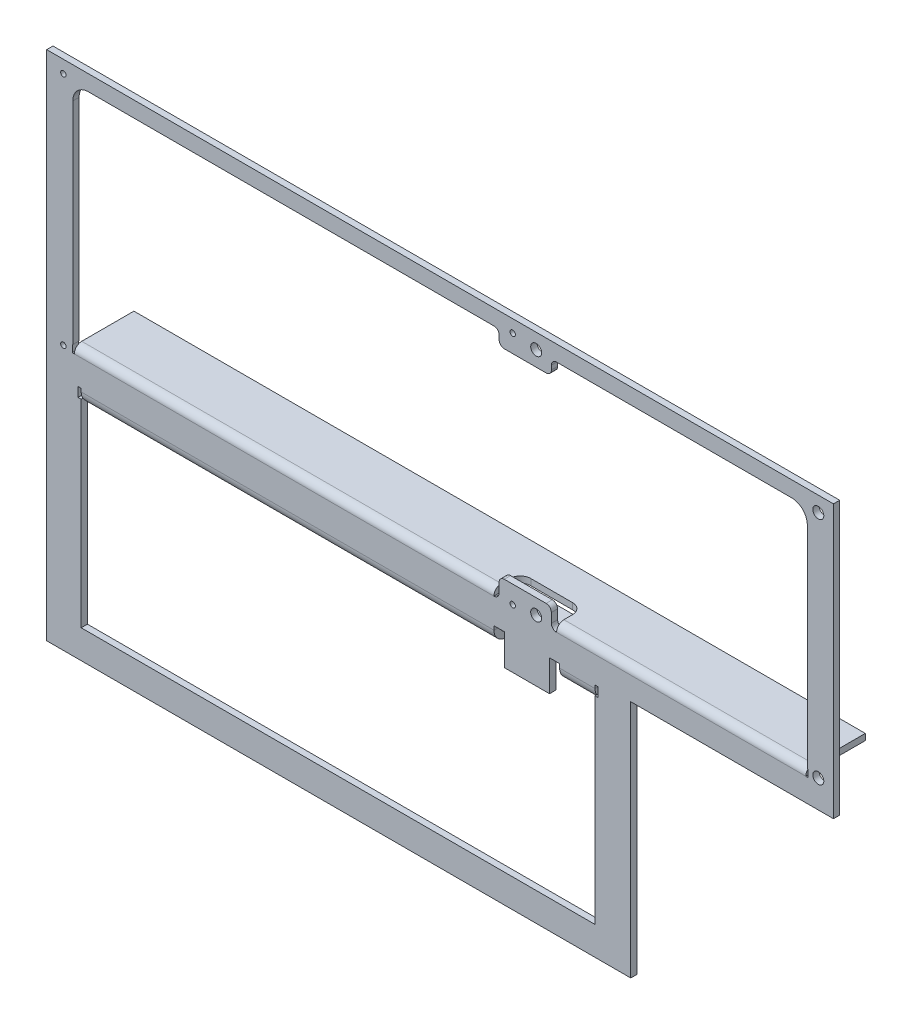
ISO-10303-21;
HEADER;
FILE_DESCRIPTION(('STEP AP214'),'2;1');
FILE_NAME('part.step','',(''),(''),'','','');
FILE_SCHEMA(('AUTOMOTIVE_DESIGN { 1 0 10303 214 1 1 1 1 }'));
ENDSEC;
DATA;
#1=APPLICATION_CONTEXT('core data for automotive mechanical design processes');
#2=APPLICATION_PROTOCOL_DEFINITION('international standard','automotive_design',2000,#1);
#3=PRODUCT_CONTEXT('',#1,'mechanical');
#4=PRODUCT('Part','Part','',(#3));
#5=PRODUCT_RELATED_PRODUCT_CATEGORY('part','',(#4));
#6=PRODUCT_DEFINITION_FORMATION('','',#4);
#7=PRODUCT_DEFINITION_CONTEXT('part definition',#1,'design');
#8=PRODUCT_DEFINITION('design','',#6,#7);
#9=PRODUCT_DEFINITION_SHAPE('','',#8);
#10=(LENGTH_UNIT() NAMED_UNIT(*) SI_UNIT(.MILLI.,.METRE.));
#11=(NAMED_UNIT(*) PLANE_ANGLE_UNIT() SI_UNIT($,.RADIAN.));
#12=(NAMED_UNIT(*) SI_UNIT($,.STERADIAN.) SOLID_ANGLE_UNIT());
#13=UNCERTAINTY_MEASURE_WITH_UNIT(LENGTH_MEASURE(1.E-05),#10,'distance_accuracy_value','');
#14=(GEOMETRIC_REPRESENTATION_CONTEXT(3) GLOBAL_UNCERTAINTY_ASSIGNED_CONTEXT((#13)) GLOBAL_UNIT_ASSIGNED_CONTEXT((#10,
#11,#12)) REPRESENTATION_CONTEXT('',''));
#15=CARTESIAN_POINT('',(0.,0.,0.));
#16=DIRECTION('',(0.,0.,1.));
#17=DIRECTION('',(1.,0.,0.));
#18=AXIS2_PLACEMENT_3D('',#15,#16,#17);
#19=CARTESIAN_POINT('',(428.096993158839,226.532700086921,0.));
#20=DIRECTION('',(0.,1.,0.));
#21=DIRECTION('',(0.,0.,1.));
#22=AXIS2_PLACEMENT_3D('',#19,#20,#21);
#23=PLANE('',#22);
#24=DIRECTION('',(-1.,0.,0.));
#25=VECTOR('',#24,1.);
#26=CARTESIAN_POINT('',(428.096993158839,226.532700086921,0.));
#27=LINE('',#26,#25);
#28=CARTESIAN_POINT('',(438.397372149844,226.532700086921,0.));
#29=VERTEX_POINT('',#28);
#30=CARTESIAN_POINT('',(428.096993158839,226.532700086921,0.));
#31=VERTEX_POINT('',#30);
#32=EDGE_CURVE('E629',#29,#31,#27,.T.);
#33=ORIENTED_EDGE('',*,*,#32,.F.);
#34=DIRECTION('',(0.,0.,1.));
#35=VECTOR('',#34,1.);
#36=CARTESIAN_POINT('',(438.397372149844,226.532700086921,0.));
#37=LINE('',#36,#35);
#38=CARTESIAN_POINT('',(438.397372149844,226.532700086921,6.));
#39=VERTEX_POINT('',#38);
#40=EDGE_CURVE('E615',#29,#39,#37,.T.);
#41=ORIENTED_EDGE('',*,*,#40,.T.);
#42=DIRECTION('',(-1.,0.,0.));
#43=VECTOR('',#42,1.);
#44=CARTESIAN_POINT('',(428.096993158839,226.532700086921,6.));
#45=LINE('',#44,#43);
#46=CARTESIAN_POINT('',(428.096993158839,226.532700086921,6.));
#47=VERTEX_POINT('',#46);
#48=EDGE_CURVE('E632',#39,#47,#45,.T.);
#49=ORIENTED_EDGE('',*,*,#48,.T.);
#50=DIRECTION('',(0.,0.,1.));
#51=VECTOR('',#50,1.);
#52=CARTESIAN_POINT('',(428.096993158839,226.532700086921,0.));
#53=LINE('',#52,#51);
#54=EDGE_CURVE('E633',#31,#47,#53,.T.);
#55=ORIENTED_EDGE('',*,*,#54,.F.);
#56=EDGE_LOOP('',(#33,#41,#49,#55));
#57=FACE_BOUND('',#56,.T.);
#58=ADVANCED_FACE('F49',(#57),#23,.F.);
#59=CARTESIAN_POINT('',(376.5,245.,0.));
#60=DIRECTION('',(0.,0.,-1.));
#61=DIRECTION('',(-1.,0.,0.));
#62=AXIS2_PLACEMENT_3D('',#59,#60,#61);
#63=PLANE('',#62);
#64=DIRECTION('',(0.,-1.,0.));
#65=VECTOR('',#64,1.);
#66=CARTESIAN_POINT('',(428.096993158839,226.532700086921,0.));
#67=LINE('',#66,#65);
#68=CARTESIAN_POINT('',(428.096993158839,222.784753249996,0.));
#69=VERTEX_POINT('',#68);
#70=EDGE_CURVE('E53',#31,#69,#67,.T.);
#71=ORIENTED_EDGE('',*,*,#70,.T.);
#72=DIRECTION('',(1.,0.,0.));
#73=VECTOR('',#72,1.);
#74=CARTESIAN_POINT('',(33.0387101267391,222.784753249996,0.));
#75=LINE('',#74,#73);
#76=CARTESIAN_POINT('',(33.0387101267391,222.784753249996,0.));
#77=VERTEX_POINT('',#76);
#78=EDGE_CURVE('E1174',#77,#69,#75,.T.);
#79=ORIENTED_EDGE('',*,*,#78,.F.);
#80=DIRECTION('',(0.,-1.,0.));
#81=VECTOR('',#80,1.);
#82=CARTESIAN_POINT('',(33.0387101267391,225.784753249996,0.));
#83=LINE('',#82,#81);
#84=CARTESIAN_POINT('',(33.0387101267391,225.784753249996,0.));
#85=VERTEX_POINT('',#84);
#86=EDGE_CURVE('E651',#85,#77,#83,.T.);
#87=ORIENTED_EDGE('',*,*,#86,.F.);
#88=DIRECTION('',(1.,0.,0.));
#89=VECTOR('',#88,1.);
#90=CARTESIAN_POINT('',(30.0387101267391,225.784753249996,0.));
#91=LINE('',#90,#89);
#92=CARTESIAN_POINT('',(30.0387101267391,225.784753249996,0.));
#93=VERTEX_POINT('',#92);
#94=EDGE_CURVE('E647',#93,#85,#91,.T.);
#95=ORIENTED_EDGE('',*,*,#94,.F.);
#96=DIRECTION('',(0.,1.,0.));
#97=VECTOR('',#96,1.);
#98=CARTESIAN_POINT('',(30.0387101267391,216.784753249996,0.));
#99=LINE('',#98,#97);
#100=CARTESIAN_POINT('',(30.0387101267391,216.784753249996,0.));
#101=VERTEX_POINT('',#100);
#102=EDGE_CURVE('E643',#101,#93,#99,.T.);
#103=ORIENTED_EDGE('',*,*,#102,.F.);
#104=DIRECTION('',(-1.,0.,0.));
#105=VECTOR('',#104,1.);
#106=CARTESIAN_POINT('',(33.0387101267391,216.784753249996,0.));
#107=LINE('',#106,#105);
#108=CARTESIAN_POINT('',(33.0387101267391,216.784753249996,0.));
#109=VERTEX_POINT('',#108);
#110=EDGE_CURVE('E639',#109,#101,#107,.T.);
#111=ORIENTED_EDGE('',*,*,#110,.F.);
#112=DIRECTION('',(0.,-1.,0.));
#113=VECTOR('',#112,1.);
#114=CARTESIAN_POINT('',(33.0387101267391,27.2980647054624,0.));
#115=LINE('',#114,#113);
#116=CARTESIAN_POINT('',(33.0387101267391,27.2980647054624,0.));
#117=VERTEX_POINT('',#116);
#118=EDGE_CURVE('E807',#109,#117,#115,.T.);
#119=ORIENTED_EDGE('',*,*,#118,.T.);
#120=DIRECTION('',(1.,0.,0.));
#121=VECTOR('',#120,1.);
#122=CARTESIAN_POINT('',(524.810656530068,27.2980647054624,0.));
#123=LINE('',#122,#121);
#124=CARTESIAN_POINT('',(524.810656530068,27.2980647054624,0.));
#125=VERTEX_POINT('',#124);
#126=EDGE_CURVE('E804',#117,#125,#123,.T.);
#127=ORIENTED_EDGE('',*,*,#126,.T.);
#128=DIRECTION('',(0.,1.,0.));
#129=VECTOR('',#128,1.);
#130=CARTESIAN_POINT('',(524.810656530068,27.2980647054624,0.));
#131=LINE('',#130,#129);
#132=CARTESIAN_POINT('',(524.810656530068,216.784753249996,0.));
#133=VERTEX_POINT('',#132);
#134=EDGE_CURVE('E810',#125,#133,#131,.T.);
#135=ORIENTED_EDGE('',*,*,#134,.T.);
#136=DIRECTION('',(-1.,0.,0.));
#137=VECTOR('',#136,1.);
#138=CARTESIAN_POINT('',(527.810656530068,216.784753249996,0.));
#139=LINE('',#138,#137);
#140=CARTESIAN_POINT('',(527.810656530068,216.784753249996,0.));
#141=VERTEX_POINT('',#140);
#142=EDGE_CURVE('E666',#141,#133,#139,.T.);
#143=ORIENTED_EDGE('',*,*,#142,.F.);
#144=DIRECTION('',(0.,-1.,0.));
#145=VECTOR('',#144,1.);
#146=CARTESIAN_POINT('',(527.810656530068,225.784753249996,0.));
#147=LINE('',#146,#145);
#148=CARTESIAN_POINT('',(527.810656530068,225.784753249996,0.));
#149=VERTEX_POINT('',#148);
#150=EDGE_CURVE('E662',#149,#141,#147,.T.);
#151=ORIENTED_EDGE('',*,*,#150,.F.);
#152=DIRECTION('',(1.,0.,0.));
#153=VECTOR('',#152,1.);
#154=CARTESIAN_POINT('',(524.810656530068,225.784753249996,0.));
#155=LINE('',#154,#153);
#156=CARTESIAN_POINT('',(524.810656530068,225.784753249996,0.));
#157=VERTEX_POINT('',#156);
#158=EDGE_CURVE('E658',#157,#149,#155,.T.);
#159=ORIENTED_EDGE('',*,*,#158,.F.);
#160=DIRECTION('',(0.,1.,0.));
#161=VECTOR('',#160,1.);
#162=CARTESIAN_POINT('',(524.810656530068,222.784753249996,0.));
#163=LINE('',#162,#161);
#164=CARTESIAN_POINT('',(524.810656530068,222.784753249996,0.));
#165=VERTEX_POINT('',#164);
#166=EDGE_CURVE('E655',#165,#157,#163,.T.);
#167=ORIENTED_EDGE('',*,*,#166,.F.);
#168=DIRECTION('',(1.,0.,0.));
#169=VECTOR('',#168,1.);
#170=CARTESIAN_POINT('',(33.0387101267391,222.784753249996,0.));
#171=LINE('',#170,#169);
#172=CARTESIAN_POINT('',(490.958323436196,222.784753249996,0.));
#173=VERTEX_POINT('',#172);
#174=EDGE_CURVE('E1185',#173,#165,#171,.T.);
#175=ORIENTED_EDGE('',*,*,#174,.F.);
#176=DIRECTION('',(0.,1.,0.));
#177=VECTOR('',#176,1.);
#178=CARTESIAN_POINT('',(490.958323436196,226.532700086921,0.));
#179=LINE('',#178,#177);
#180=CARTESIAN_POINT('',(490.958323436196,226.532700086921,0.));
#181=VERTEX_POINT('',#180);
#182=EDGE_CURVE('E1194',#173,#181,#179,.T.);
#183=ORIENTED_EDGE('',*,*,#182,.T.);
#184=CARTESIAN_POINT('',(481.263401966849,226.532700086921,0.));
#185=VERTEX_POINT('',#184);
#186=EDGE_CURVE('E625',#181,#185,#27,.T.);
#187=ORIENTED_EDGE('',*,*,#186,.T.);
#188=DIRECTION('',(0.,1.,0.));
#189=VECTOR('',#188,1.);
#190=CARTESIAN_POINT('',(481.263401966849,226.532700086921,0.));
#191=LINE('',#190,#189);
#192=CARTESIAN_POINT('',(481.263401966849,196.737591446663,0.));
#193=VERTEX_POINT('',#192);
#194=EDGE_CURVE('E604',#193,#185,#191,.T.);
#195=ORIENTED_EDGE('',*,*,#194,.F.);
#196=DIRECTION('',(1.,0.,0.));
#197=VECTOR('',#196,1.);
#198=CARTESIAN_POINT('',(438.397372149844,196.737591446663,0.));
#199=LINE('',#198,#197);
#200=CARTESIAN_POINT('',(438.397372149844,196.737591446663,0.));
#201=VERTEX_POINT('',#200);
#202=EDGE_CURVE('E600',#201,#193,#199,.T.);
#203=ORIENTED_EDGE('',*,*,#202,.F.);
#204=DIRECTION('',(0.,-1.,0.));
#205=VECTOR('',#204,1.);
#206=CARTESIAN_POINT('',(438.397372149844,226.532700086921,0.));
#207=LINE('',#206,#205);
#208=EDGE_CURVE('E597',#29,#201,#207,.T.);
#209=ORIENTED_EDGE('',*,*,#208,.F.);
#210=ORIENTED_EDGE('',*,*,#32,.T.);
#211=EDGE_LOOP('',(#71,#79,#87,#95,#103,#111,#119,#127,#135,#143,#151,#159,#167,#175,#183,#187,
#195,#203,#209,#210));
#212=FACE_BOUND('',#211,.T.);
#213=CARTESIAN_POINT('',(468.5,475.5,0.));
#214=DIRECTION('',(0.,0.,-1.));
#215=DIRECTION('',(-1.,0.,0.));
#216=AXIS2_PLACEMENT_3D('',#213,#214,#215);
#217=CIRCLE('',#216,5.25);
#218=CARTESIAN_POINT('',(463.25,475.5,0.));
#219=VERTEX_POINT('',#218);
#220=EDGE_CURVE('E1064',#219,#219,#217,.T.);
#221=ORIENTED_EDGE('',*,*,#220,.F.);
#222=EDGE_LOOP('',(#221));
#223=FACE_BOUND('',#222,.T.);
#224=CARTESIAN_POINT('',(738.5,475.5,0.));
#225=DIRECTION('',(0.,0.,-1.));
#226=DIRECTION('',(-1.,0.,0.));
#227=AXIS2_PLACEMENT_3D('',#224,#225,#226);
#228=CIRCLE('',#227,5.25);
#229=CARTESIAN_POINT('',(733.25,475.5,0.));
#230=VERTEX_POINT('',#229);
#231=EDGE_CURVE('E1061',#230,#230,#228,.T.);
#232=ORIENTED_EDGE('',*,*,#231,.F.);
#233=EDGE_LOOP('',(#232));
#234=FACE_BOUND('',#233,.T.);
#235=CARTESIAN_POINT('',(738.5,255.5,0.));
#236=DIRECTION('',(0.,0.,-1.));
#237=DIRECTION('',(-1.,0.,0.));
#238=AXIS2_PLACEMENT_3D('',#235,#236,#237);
#239=CIRCLE('',#238,5.25);
#240=CARTESIAN_POINT('',(733.25,255.5,0.));
#241=VERTEX_POINT('',#240);
#242=EDGE_CURVE('E1058',#241,#241,#239,.T.);
#243=ORIENTED_EDGE('',*,*,#242,.F.);
#244=EDGE_LOOP('',(#243));
#245=FACE_BOUND('',#244,.T.);
#246=CARTESIAN_POINT('',(16.,478.,0.));
#247=DIRECTION('',(0.,0.,-1.));
#248=DIRECTION('',(-1.,0.,0.));
#249=AXIS2_PLACEMENT_3D('',#246,#247,#248);
#250=CIRCLE('',#249,2.59405);
#251=CARTESIAN_POINT('',(13.40595,478.,0.));
#252=VERTEX_POINT('',#251);
#253=EDGE_CURVE('E1055',#252,#252,#250,.T.);
#254=ORIENTED_EDGE('',*,*,#253,.F.);
#255=EDGE_LOOP('',(#254));
#256=FACE_BOUND('',#255,.T.);
#257=CARTESIAN_POINT('',(446.,478.,0.));
#258=DIRECTION('',(0.,0.,-1.));
#259=DIRECTION('',(-1.,0.,0.));
#260=AXIS2_PLACEMENT_3D('',#257,#258,#259);
#261=CIRCLE('',#260,2.59405);
#262=CARTESIAN_POINT('',(443.40595,478.,0.));
#263=VERTEX_POINT('',#262);
#264=EDGE_CURVE('E1052',#263,#263,#261,.T.);
#265=ORIENTED_EDGE('',*,*,#264,.F.);
#266=EDGE_LOOP('',(#265));
#267=FACE_BOUND('',#266,.T.);
#268=DIRECTION('',(1.,0.,0.));
#269=VECTOR('',#268,1.);
#270=CARTESIAN_POINT('',(376.5,0.,0.));
#271=LINE('',#270,#269);
#272=CARTESIAN_POINT('',(0.,0.,0.));
#273=VERTEX_POINT('',#272);
#274=CARTESIAN_POINT('',(559.,0.,0.));
#275=VERTEX_POINT('',#274);
#276=EDGE_CURVE('E1004',#273,#275,#271,.T.);
#277=ORIENTED_EDGE('',*,*,#276,.F.);
#278=DIRECTION('',(0.,-1.,0.));
#279=VECTOR('',#278,1.);
#280=CARTESIAN_POINT('',(0.,245.,0.));
#281=LINE('',#280,#279);
#282=CARTESIAN_POINT('',(0.,490.,0.));
#283=VERTEX_POINT('',#282);
#284=EDGE_CURVE('E1009',#283,#273,#281,.T.);
#285=ORIENTED_EDGE('',*,*,#284,.F.);
#286=DIRECTION('',(-1.,0.,0.));
#287=VECTOR('',#286,1.);
#288=CARTESIAN_POINT('',(376.5,490.,0.));
#289=LINE('',#288,#287);
#290=CARTESIAN_POINT('',(753.,490.,0.));
#291=VERTEX_POINT('',#290);
#292=EDGE_CURVE('E1014',#291,#283,#289,.T.);
#293=ORIENTED_EDGE('',*,*,#292,.F.);
#294=DIRECTION('',(0.,1.,0.));
#295=VECTOR('',#294,1.);
#296=CARTESIAN_POINT('',(753.,245.,0.));
#297=LINE('',#296,#295);
#298=CARTESIAN_POINT('',(753.,229.,0.));
#299=VERTEX_POINT('',#298);
#300=EDGE_CURVE('E1019',#299,#291,#297,.T.);
#301=ORIENTED_EDGE('',*,*,#300,.F.);
#302=DIRECTION('',(1.,0.,0.));
#303=VECTOR('',#302,1.);
#304=CARTESIAN_POINT('',(559.,229.,0.));
#305=LINE('',#304,#303);
#306=CARTESIAN_POINT('',(559.,229.,0.));
#307=VERTEX_POINT('',#306);
#308=EDGE_CURVE('E1024',#307,#299,#305,.T.);
#309=ORIENTED_EDGE('',*,*,#308,.F.);
#310=DIRECTION('',(0.,1.,0.));
#311=VECTOR('',#310,1.);
#312=CARTESIAN_POINT('',(559.,0.,0.));
#313=LINE('',#312,#311);
#314=EDGE_CURVE('E1031',#275,#307,#313,.T.);
#315=ORIENTED_EDGE('',*,*,#314,.F.);
#316=EDGE_LOOP('',(#277,#285,#293,#301,#309,#315));
#317=FACE_BOUND('',#316,.T.);
#318=CARTESIAN_POINT('',(16.,253.,0.));
#319=DIRECTION('',(0.,0.,-1.));
#320=DIRECTION('',(-1.,0.,0.));
#321=AXIS2_PLACEMENT_3D('',#318,#319,#320);
#322=CIRCLE('',#321,2.59405);
#323=CARTESIAN_POINT('',(13.40595,253.,0.));
#324=VERTEX_POINT('',#323);
#325=EDGE_CURVE('E998',#324,#324,#322,.T.);
#326=ORIENTED_EDGE('',*,*,#325,.F.);
#327=EDGE_LOOP('',(#326));
#328=FACE_BOUND('',#327,.T.);
#329=DIRECTION('',(-1.,0.,0.));
#330=VECTOR('',#329,1.);
#331=CARTESIAN_POINT('',(376.5,251.,0.));
#332=LINE('',#331,#330);
#333=CARTESIAN_POINT('',(728.5,251.,0.));
#334=VERTEX_POINT('',#333);
#335=CARTESIAN_POINT('',(726.5,251.,0.));
#336=VERTEX_POINT('',#335);
#337=EDGE_CURVE('E712',#334,#336,#332,.T.);
#338=ORIENTED_EDGE('',*,*,#337,.F.);
#339=DIRECTION('',(0.,-1.,0.));
#340=VECTOR('',#339,1.);
#341=CARTESIAN_POINT('',(728.5,245.,0.));
#342=LINE('',#341,#340);
#343=CARTESIAN_POINT('',(728.5,258.,0.));
#344=VERTEX_POINT('',#343);
#345=EDGE_CURVE('E868',#344,#334,#342,.T.);
#346=ORIENTED_EDGE('',*,*,#345,.F.);
#347=DIRECTION('',(1.,0.,0.));
#348=VECTOR('',#347,1.);
#349=CARTESIAN_POINT('',(376.5,258.,0.));
#350=LINE('',#349,#348);
#351=CARTESIAN_POINT('',(728.,258.,0.));
#352=VERTEX_POINT('',#351);
#353=EDGE_CURVE('E873',#352,#344,#350,.T.);
#354=ORIENTED_EDGE('',*,*,#353,.F.);
#355=DIRECTION('',(0.,-1.,0.));
#356=VECTOR('',#355,1.);
#357=CARTESIAN_POINT('',(728.,475.,0.));
#358=LINE('',#357,#356);
#359=CARTESIAN_POINT('',(728.,460.,0.));
#360=VERTEX_POINT('',#359);
#361=EDGE_CURVE('E877',#360,#352,#358,.T.);
#362=ORIENTED_EDGE('',*,*,#361,.F.);
#363=CARTESIAN_POINT('',(713.,460.,0.));
#364=DIRECTION('',(0.,0.,-1.));
#365=DIRECTION('',(-1.,0.,0.));
#366=AXIS2_PLACEMENT_3D('',#363,#364,#365);
#367=CIRCLE('',#366,15.);
#368=CARTESIAN_POINT('',(713.,475.,0.));
#369=VERTEX_POINT('',#368);
#370=EDGE_CURVE('E856',#360,#369,#367,.F.);
#371=ORIENTED_EDGE('',*,*,#370,.T.);
#372=DIRECTION('',(1.,0.,0.));
#373=VECTOR('',#372,1.);
#374=CARTESIAN_POINT('',(24.9999999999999,475.,0.));
#375=LINE('',#374,#373);
#376=CARTESIAN_POINT('',(488.066674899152,475.,0.));
#377=VERTEX_POINT('',#376);
#378=EDGE_CURVE('E887',#377,#369,#375,.T.);
#379=ORIENTED_EDGE('',*,*,#378,.F.);
#380=CARTESIAN_POINT('',(488.066674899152,470.,0.));
#381=DIRECTION('',(0.,0.,-1.));
#382=DIRECTION('',(-1.,0.,0.));
#383=AXIS2_PLACEMENT_3D('',#380,#381,#382);
#384=CIRCLE('',#383,5.);
#385=CARTESIAN_POINT('',(483.066674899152,470.,0.));
#386=VERTEX_POINT('',#385);
#387=EDGE_CURVE('E853',#377,#386,#384,.F.);
#388=ORIENTED_EDGE('',*,*,#387,.T.);
#389=DIRECTION('',(0.,-1.,0.));
#390=VECTOR('',#389,1.);
#391=CARTESIAN_POINT('',(483.066674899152,461.,0.));
#392=LINE('',#391,#390);
#393=CARTESIAN_POINT('',(483.066674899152,466.,0.));
#394=VERTEX_POINT('',#393);
#395=EDGE_CURVE('E849',#386,#394,#392,.T.);
#396=ORIENTED_EDGE('',*,*,#395,.T.);
#397=CARTESIAN_POINT('',(478.066674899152,466.,0.));
#398=DIRECTION('',(0.,0.,-1.));
#399=DIRECTION('',(-1.,0.,0.));
#400=AXIS2_PLACEMENT_3D('',#397,#398,#399);
#401=CIRCLE('',#400,5.);
#402=CARTESIAN_POINT('',(478.066674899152,461.,0.));
#403=VERTEX_POINT('',#402);
#404=EDGE_CURVE('E846',#394,#403,#401,.T.);
#405=ORIENTED_EDGE('',*,*,#404,.T.);
#406=DIRECTION('',(1.,0.,0.));
#407=VECTOR('',#406,1.);
#408=CARTESIAN_POINT('',(433.066674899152,461.,0.));
#409=LINE('',#408,#407);
#410=CARTESIAN_POINT('',(438.066674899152,461.,0.));
#411=VERTEX_POINT('',#410);
#412=EDGE_CURVE('E910',#411,#403,#409,.T.);
#413=ORIENTED_EDGE('',*,*,#412,.F.);
#414=CARTESIAN_POINT('',(438.066674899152,466.,0.));
#415=DIRECTION('',(0.,0.,-1.));
#416=DIRECTION('',(-1.,0.,0.));
#417=AXIS2_PLACEMENT_3D('',#414,#415,#416);
#418=CIRCLE('',#417,5.);
#419=CARTESIAN_POINT('',(433.066674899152,466.,0.));
#420=VERTEX_POINT('',#419);
#421=EDGE_CURVE('E843',#411,#420,#418,.T.);
#422=ORIENTED_EDGE('',*,*,#421,.T.);
#423=DIRECTION('',(0.,-1.,0.));
#424=VECTOR('',#423,1.);
#425=CARTESIAN_POINT('',(433.066674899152,461.,0.));
#426=LINE('',#425,#424);
#427=CARTESIAN_POINT('',(433.066674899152,470.,0.));
#428=VERTEX_POINT('',#427);
#429=EDGE_CURVE('E920',#428,#420,#426,.T.);
#430=ORIENTED_EDGE('',*,*,#429,.F.);
#431=CARTESIAN_POINT('',(428.066674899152,470.,0.));
#432=DIRECTION('',(0.,0.,-1.));
#433=DIRECTION('',(-1.,0.,0.));
#434=AXIS2_PLACEMENT_3D('',#431,#432,#433);
#435=CIRCLE('',#434,5.);
#436=CARTESIAN_POINT('',(428.066674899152,475.,0.));
#437=VERTEX_POINT('',#436);
#438=EDGE_CURVE('E840',#428,#437,#435,.F.);
#439=ORIENTED_EDGE('',*,*,#438,.T.);
#440=CARTESIAN_POINT('',(39.9999999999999,475.,0.));
#441=VERTEX_POINT('',#440);
#442=EDGE_CURVE('E892',#441,#437,#375,.T.);
#443=ORIENTED_EDGE('',*,*,#442,.F.);
#444=CARTESIAN_POINT('',(39.9999999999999,460.,0.));
#445=DIRECTION('',(0.,0.,-1.));
#446=DIRECTION('',(-1.,0.,0.));
#447=AXIS2_PLACEMENT_3D('',#444,#445,#446);
#448=CIRCLE('',#447,15.);
#449=CARTESIAN_POINT('',(24.9999999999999,460.,0.));
#450=VERTEX_POINT('',#449);
#451=EDGE_CURVE('E837',#441,#450,#448,.F.);
#452=ORIENTED_EDGE('',*,*,#451,.T.);
#453=DIRECTION('',(0.,-1.,0.));
#454=VECTOR('',#453,1.);
#455=CARTESIAN_POINT('',(24.9999999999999,475.,0.));
#456=LINE('',#455,#454);
#457=CARTESIAN_POINT('',(24.9999999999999,258.,0.));
#458=VERTEX_POINT('',#457);
#459=EDGE_CURVE('E833',#450,#458,#456,.T.);
#460=ORIENTED_EDGE('',*,*,#459,.T.);
#461=DIRECTION('',(1.,0.,0.));
#462=VECTOR('',#461,1.);
#463=CARTESIAN_POINT('',(376.5,258.,0.));
#464=LINE('',#463,#462);
#465=CARTESIAN_POINT('',(24.4999999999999,258.,0.));
#466=VERTEX_POINT('',#465);
#467=EDGE_CURVE('E945',#466,#458,#464,.T.);
#468=ORIENTED_EDGE('',*,*,#467,.F.);
#469=DIRECTION('',(0.,1.,0.));
#470=VECTOR('',#469,1.);
#471=CARTESIAN_POINT('',(24.4999999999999,245.,0.));
#472=LINE('',#471,#470);
#473=CARTESIAN_POINT('',(24.4999999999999,251.,0.));
#474=VERTEX_POINT('',#473);
#475=EDGE_CURVE('E948',#474,#466,#472,.T.);
#476=ORIENTED_EDGE('',*,*,#475,.F.);
#477=DIRECTION('',(1.,0.,0.));
#478=VECTOR('',#477,1.);
#479=CARTESIAN_POINT('',(24.9999999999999,251.,0.));
#480=LINE('',#479,#478);
#481=CARTESIAN_POINT('',(26.4999999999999,251.,0.));
#482=VERTEX_POINT('',#481);
#483=EDGE_CURVE('E818',#474,#482,#480,.T.);
#484=ORIENTED_EDGE('',*,*,#483,.T.);
#485=CARTESIAN_POINT('',(428.,251.,0.));
#486=VERTEX_POINT('',#485);
#487=EDGE_CURVE('E817',#482,#486,#480,.T.);
#488=ORIENTED_EDGE('',*,*,#487,.T.);
#489=DIRECTION('',(-1.,0.,0.));
#490=VECTOR('',#489,1.);
#491=CARTESIAN_POINT('',(376.5,251.,0.));
#492=LINE('',#491,#490);
#493=CARTESIAN_POINT('',(429.,251.,0.));
#494=VERTEX_POINT('',#493);
#495=EDGE_CURVE('E801',#494,#486,#492,.T.);
#496=ORIENTED_EDGE('',*,*,#495,.F.);
#497=DIRECTION('',(0.,-1.,0.));
#498=VECTOR('',#497,1.);
#499=CARTESIAN_POINT('',(429.,245.,0.));
#500=LINE('',#499,#498);
#501=CARTESIAN_POINT('',(429.,251.101020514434,0.));
#502=VERTEX_POINT('',#501);
#503=EDGE_CURVE('E954',#502,#494,#500,.T.);
#504=ORIENTED_EDGE('',*,*,#503,.F.);
#505=CARTESIAN_POINT('',(428.,256.,0.));
#506=DIRECTION('',(0.,0.,-1.));
#507=DIRECTION('',(-1.,0.,0.));
#508=AXIS2_PLACEMENT_3D('',#505,#506,#507);
#509=CIRCLE('',#508,5.);
#510=CARTESIAN_POINT('',(433.,256.,0.));
#511=VERTEX_POINT('',#510);
#512=EDGE_CURVE('E830',#502,#511,#509,.F.);
#513=ORIENTED_EDGE('',*,*,#512,.T.);
#514=DIRECTION('',(0.,1.,0.));
#515=VECTOR('',#514,1.);
#516=CARTESIAN_POINT('',(433.,270.,1.02348685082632E-13));
#517=LINE('',#516,#515);
#518=CARTESIAN_POINT('',(433.,265.,0.));
#519=VERTEX_POINT('',#518);
#520=EDGE_CURVE('E827',#511,#519,#517,.T.);
#521=ORIENTED_EDGE('',*,*,#520,.T.);
#522=CARTESIAN_POINT('',(438.,265.,0.));
#523=DIRECTION('',(0.,0.,-1.));
#524=DIRECTION('',(-1.,0.,0.));
#525=AXIS2_PLACEMENT_3D('',#522,#523,#524);
#526=CIRCLE('',#525,5.);
#527=CARTESIAN_POINT('',(438.,270.,1.02348685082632E-13));
#528=VERTEX_POINT('',#527);
#529=EDGE_CURVE('E824',#519,#528,#526,.T.);
#530=ORIENTED_EDGE('',*,*,#529,.T.);
#531=DIRECTION('',(-1.,0.,0.));
#532=VECTOR('',#531,1.);
#533=CARTESIAN_POINT('',(483.,270.,1.02348685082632E-13));
#534=LINE('',#533,#532);
#535=CARTESIAN_POINT('',(478.,270.,1.02348685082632E-13));
#536=VERTEX_POINT('',#535);
#537=EDGE_CURVE('E974',#536,#528,#534,.T.);
#538=ORIENTED_EDGE('',*,*,#537,.F.);
#539=CARTESIAN_POINT('',(478.,265.,0.));
#540=DIRECTION('',(0.,0.,-1.));
#541=DIRECTION('',(-1.,0.,0.));
#542=AXIS2_PLACEMENT_3D('',#539,#540,#541);
#543=CIRCLE('',#542,5.);
#544=CARTESIAN_POINT('',(483.,265.,0.));
#545=VERTEX_POINT('',#544);
#546=EDGE_CURVE('E821',#536,#545,#543,.T.);
#547=ORIENTED_EDGE('',*,*,#546,.T.);
#548=DIRECTION('',(0.,1.,0.));
#549=VECTOR('',#548,1.);
#550=CARTESIAN_POINT('',(483.,270.,1.02348685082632E-13));
#551=LINE('',#550,#549);
#552=CARTESIAN_POINT('',(483.,256.,0.));
#553=VERTEX_POINT('',#552);
#554=EDGE_CURVE('E983',#553,#545,#551,.T.);
#555=ORIENTED_EDGE('',*,*,#554,.F.);
#556=CARTESIAN_POINT('',(488.,256.,0.));
#557=DIRECTION('',(0.,0.,-1.));
#558=DIRECTION('',(-1.,0.,0.));
#559=AXIS2_PLACEMENT_3D('',#556,#557,#558);
#560=CIRCLE('',#559,5.);
#561=CARTESIAN_POINT('',(487.,251.101020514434,0.));
#562=VERTEX_POINT('',#561);
#563=EDGE_CURVE('E816',#553,#562,#560,.F.);
#564=ORIENTED_EDGE('',*,*,#563,.T.);
#565=DIRECTION('',(0.,1.,0.));
#566=VECTOR('',#565,1.);
#567=CARTESIAN_POINT('',(487.,245.,0.));
#568=LINE('',#567,#566);
#569=CARTESIAN_POINT('',(487.,251.,0.));
#570=VERTEX_POINT('',#569);
#571=EDGE_CURVE('E995',#570,#562,#568,.T.);
#572=ORIENTED_EDGE('',*,*,#571,.F.);
#573=DIRECTION('',(-1.,0.,0.));
#574=VECTOR('',#573,1.);
#575=CARTESIAN_POINT('',(376.5,251.,0.));
#576=LINE('',#575,#574);
#577=CARTESIAN_POINT('',(488.,251.,0.));
#578=VERTEX_POINT('',#577);
#579=EDGE_CURVE('E707',#578,#570,#576,.T.);
#580=ORIENTED_EDGE('',*,*,#579,.F.);
#581=EDGE_CURVE('E813',#578,#336,#480,.T.);
#582=ORIENTED_EDGE('',*,*,#581,.T.);
#583=EDGE_LOOP('',(#338,#346,#354,#362,#371,#379,#388,#396,#405,#413,#422,#430,#439,#443,#452,
#460,#468,#476,#484,#488,#496,#504,#513,#521,#530,#538,#547,#555,#564,#572,#580,#582));
#584=FACE_BOUND('',#583,.T.);
#585=CARTESIAN_POINT('',(446.,253.,0.));
#586=DIRECTION('',(0.,0.,-1.));
#587=DIRECTION('',(-1.,0.,0.));
#588=AXIS2_PLACEMENT_3D('',#585,#586,#587);
#589=CIRCLE('',#588,2.59405);
#590=CARTESIAN_POINT('',(443.40595,253.,0.));
#591=VERTEX_POINT('',#590);
#592=EDGE_CURVE('E862',#591,#591,#589,.T.);
#593=ORIENTED_EDGE('',*,*,#592,.F.);
#594=EDGE_LOOP('',(#593));
#595=FACE_BOUND('',#594,.T.);
#596=CARTESIAN_POINT('',(468.5,255.5,0.));
#597=DIRECTION('',(0.,0.,-1.));
#598=DIRECTION('',(-1.,0.,0.));
#599=AXIS2_PLACEMENT_3D('',#596,#597,#598);
#600=CIRCLE('',#599,5.25);
#601=CARTESIAN_POINT('',(463.25,255.5,0.));
#602=VERTEX_POINT('',#601);
#603=EDGE_CURVE('E859',#602,#602,#600,.T.);
#604=ORIENTED_EDGE('',*,*,#603,.F.);
#605=EDGE_LOOP('',(#604));
#606=FACE_BOUND('',#605,.T.);
#607=ADVANCED_FACE('F1202',(#212,#223,#234,#245,#256,#267,#317,#328,#584,#595,#606),#63,.T.);
#608=CARTESIAN_POINT('',(376.5,245.,6.));
#609=DIRECTION('',(0.,0.,-1.));
#610=DIRECTION('',(-1.,0.,0.));
#611=AXIS2_PLACEMENT_3D('',#608,#609,#610);
#612=PLANE('',#611);
#613=CARTESIAN_POINT('',(446.,478.,6.));
#614=DIRECTION('',(0.,0.,-1.));
#615=DIRECTION('',(-1.,0.,0.));
#616=AXIS2_PLACEMENT_3D('',#613,#614,#615);
#617=CIRCLE('',#616,2.59405);
#618=CARTESIAN_POINT('',(443.40595,478.,6.));
#619=VERTEX_POINT('',#618);
#620=EDGE_CURVE('E724',#619,#619,#617,.T.);
#621=ORIENTED_EDGE('',*,*,#620,.T.);
#622=EDGE_LOOP('',(#621));
#623=FACE_BOUND('',#622,.T.);
#624=CARTESIAN_POINT('',(16.,478.,6.));
#625=DIRECTION('',(0.,0.,-1.));
#626=DIRECTION('',(-1.,0.,0.));
#627=AXIS2_PLACEMENT_3D('',#624,#625,#626);
#628=CIRCLE('',#627,2.59405);
#629=CARTESIAN_POINT('',(13.40595,478.,6.));
#630=VERTEX_POINT('',#629);
#631=EDGE_CURVE('E727',#630,#630,#628,.T.);
#632=ORIENTED_EDGE('',*,*,#631,.T.);
#633=EDGE_LOOP('',(#632));
#634=FACE_BOUND('',#633,.T.);
#635=CARTESIAN_POINT('',(738.5,255.5,6.));
#636=DIRECTION('',(0.,0.,-1.));
#637=DIRECTION('',(-1.,0.,0.));
#638=AXIS2_PLACEMENT_3D('',#635,#636,#637);
#639=CIRCLE('',#638,5.25);
#640=CARTESIAN_POINT('',(733.25,255.5,6.));
#641=VERTEX_POINT('',#640);
#642=EDGE_CURVE('E730',#641,#641,#639,.T.);
#643=ORIENTED_EDGE('',*,*,#642,.T.);
#644=EDGE_LOOP('',(#643));
#645=FACE_BOUND('',#644,.T.);
#646=CARTESIAN_POINT('',(738.5,475.5,6.));
#647=DIRECTION('',(0.,0.,-1.));
#648=DIRECTION('',(-1.,0.,0.));
#649=AXIS2_PLACEMENT_3D('',#646,#647,#648);
#650=CIRCLE('',#649,5.25);
#651=CARTESIAN_POINT('',(733.25,475.5,6.));
#652=VERTEX_POINT('',#651);
#653=EDGE_CURVE('E733',#652,#652,#650,.T.);
#654=ORIENTED_EDGE('',*,*,#653,.T.);
#655=EDGE_LOOP('',(#654));
#656=FACE_BOUND('',#655,.T.);
#657=CARTESIAN_POINT('',(468.5,475.5,6.));
#658=DIRECTION('',(0.,0.,-1.));
#659=DIRECTION('',(-1.,0.,0.));
#660=AXIS2_PLACEMENT_3D('',#657,#658,#659);
#661=CIRCLE('',#660,5.25);
#662=CARTESIAN_POINT('',(463.25,475.5,6.));
#663=VERTEX_POINT('',#662);
#664=EDGE_CURVE('E736',#663,#663,#661,.T.);
#665=ORIENTED_EDGE('',*,*,#664,.T.);
#666=EDGE_LOOP('',(#665));
#667=FACE_BOUND('',#666,.T.);
#668=DIRECTION('',(0.,-1.,0.));
#669=VECTOR('',#668,1.);
#670=CARTESIAN_POINT('',(0.,245.,6.));
#671=LINE('',#670,#669);
#672=CARTESIAN_POINT('',(0.,490.,6.));
#673=VERTEX_POINT('',#672);
#674=CARTESIAN_POINT('',(0.,0.,6.));
#675=VERTEX_POINT('',#674);
#676=EDGE_CURVE('E752',#673,#675,#671,.T.);
#677=ORIENTED_EDGE('',*,*,#676,.T.);
#678=DIRECTION('',(1.,0.,0.));
#679=VECTOR('',#678,1.);
#680=CARTESIAN_POINT('',(376.5,0.,6.));
#681=LINE('',#680,#679);
#682=CARTESIAN_POINT('',(559.,0.,6.));
#683=VERTEX_POINT('',#682);
#684=EDGE_CURVE('E750',#675,#683,#681,.T.);
#685=ORIENTED_EDGE('',*,*,#684,.T.);
#686=DIRECTION('',(0.,1.,0.));
#687=VECTOR('',#686,1.);
#688=CARTESIAN_POINT('',(559.,0.,6.));
#689=LINE('',#688,#687);
#690=CARTESIAN_POINT('',(559.,229.,6.));
#691=VERTEX_POINT('',#690);
#692=EDGE_CURVE('E747',#683,#691,#689,.T.);
#693=ORIENTED_EDGE('',*,*,#692,.T.);
#694=DIRECTION('',(1.,0.,0.));
#695=VECTOR('',#694,1.);
#696=CARTESIAN_POINT('',(559.,229.,6.));
#697=LINE('',#696,#695);
#698=CARTESIAN_POINT('',(753.,229.,6.));
#699=VERTEX_POINT('',#698);
#700=EDGE_CURVE('E743',#691,#699,#697,.T.);
#701=ORIENTED_EDGE('',*,*,#700,.T.);
#702=DIRECTION('',(0.,1.,0.));
#703=VECTOR('',#702,1.);
#704=CARTESIAN_POINT('',(753.,245.,6.));
#705=LINE('',#704,#703);
#706=CARTESIAN_POINT('',(753.,490.,6.));
#707=VERTEX_POINT('',#706);
#708=EDGE_CURVE('E741',#699,#707,#705,.T.);
#709=ORIENTED_EDGE('',*,*,#708,.T.);
#710=DIRECTION('',(-1.,0.,0.));
#711=VECTOR('',#710,1.);
#712=CARTESIAN_POINT('',(376.5,490.,6.));
#713=LINE('',#712,#711);
#714=EDGE_CURVE('E739',#707,#673,#713,.T.);
#715=ORIENTED_EDGE('',*,*,#714,.T.);
#716=EDGE_LOOP('',(#677,#685,#693,#701,#709,#715));
#717=FACE_BOUND('',#716,.T.);
#718=CARTESIAN_POINT('',(16.,253.,6.));
#719=DIRECTION('',(0.,0.,-1.));
#720=DIRECTION('',(-1.,0.,0.));
#721=AXIS2_PLACEMENT_3D('',#718,#719,#720);
#722=CIRCLE('',#721,2.59405);
#723=CARTESIAN_POINT('',(13.40595,253.,6.));
#724=VERTEX_POINT('',#723);
#725=EDGE_CURVE('E754',#724,#724,#722,.T.);
#726=ORIENTED_EDGE('',*,*,#725,.T.);
#727=EDGE_LOOP('',(#726));
#728=FACE_BOUND('',#727,.T.);
#729=DIRECTION('',(-1.,0.,0.));
#730=VECTOR('',#729,1.);
#731=CARTESIAN_POINT('',(376.5,251.,6.));
#732=LINE('',#731,#730);
#733=CARTESIAN_POINT('',(488.,251.,6.00000000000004));
#734=VERTEX_POINT('',#733);
#735=CARTESIAN_POINT('',(487.,251.,6.));
#736=VERTEX_POINT('',#735);
#737=EDGE_CURVE('E790',#734,#736,#732,.T.);
#738=ORIENTED_EDGE('',*,*,#737,.T.);
#739=DIRECTION('',(0.,1.,0.));
#740=VECTOR('',#739,1.);
#741=CARTESIAN_POINT('',(487.,245.,6.));
#742=LINE('',#741,#740);
#743=CARTESIAN_POINT('',(487.,251.101020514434,6.));
#744=VERTEX_POINT('',#743);
#745=EDGE_CURVE('E788',#736,#744,#742,.T.);
#746=ORIENTED_EDGE('',*,*,#745,.T.);
#747=CARTESIAN_POINT('',(488.,256.,6.));
#748=DIRECTION('',(0.,0.,-1.));
#749=DIRECTION('',(-1.,0.,0.));
#750=AXIS2_PLACEMENT_3D('',#747,#748,#749);
#751=CIRCLE('',#750,5.);
#752=CARTESIAN_POINT('',(483.,256.,6.00000000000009));
#753=VERTEX_POINT('',#752);
#754=EDGE_CURVE('E989',#753,#744,#751,.F.);
#755=ORIENTED_EDGE('',*,*,#754,.F.);
#756=DIRECTION('',(0.,1.,0.));
#757=VECTOR('',#756,1.);
#758=CARTESIAN_POINT('',(483.,270.,6.0000000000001));
#759=LINE('',#758,#757);
#760=CARTESIAN_POINT('',(483.,265.,6.0000000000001));
#761=VERTEX_POINT('',#760);
#762=EDGE_CURVE('E786',#753,#761,#759,.T.);
#763=ORIENTED_EDGE('',*,*,#762,.T.);
#764=CARTESIAN_POINT('',(478.,265.,6.));
#765=DIRECTION('',(0.,0.,-1.));
#766=DIRECTION('',(-1.,0.,0.));
#767=AXIS2_PLACEMENT_3D('',#764,#765,#766);
#768=CIRCLE('',#767,5.);
#769=CARTESIAN_POINT('',(478.,270.,6.0000000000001));
#770=VERTEX_POINT('',#769);
#771=EDGE_CURVE('E980',#770,#761,#768,.T.);
#772=ORIENTED_EDGE('',*,*,#771,.F.);
#773=DIRECTION('',(-1.,0.,0.));
#774=VECTOR('',#773,1.);
#775=CARTESIAN_POINT('',(483.,270.,6.0000000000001));
#776=LINE('',#775,#774);
#777=CARTESIAN_POINT('',(438.,270.,6.0000000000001));
#778=VERTEX_POINT('',#777);
#779=EDGE_CURVE('E784',#770,#778,#776,.T.);
#780=ORIENTED_EDGE('',*,*,#779,.T.);
#781=CARTESIAN_POINT('',(438.,265.,6.));
#782=DIRECTION('',(0.,0.,-1.));
#783=DIRECTION('',(-1.,0.,0.));
#784=AXIS2_PLACEMENT_3D('',#781,#782,#783);
#785=CIRCLE('',#784,5.);
#786=CARTESIAN_POINT('',(433.,265.,6.0000000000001));
#787=VERTEX_POINT('',#786);
#788=EDGE_CURVE('E969',#787,#778,#785,.T.);
#789=ORIENTED_EDGE('',*,*,#788,.F.);
#790=DIRECTION('',(0.,1.,0.));
#791=VECTOR('',#790,1.);
#792=CARTESIAN_POINT('',(433.,270.,6.0000000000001));
#793=LINE('',#792,#791);
#794=CARTESIAN_POINT('',(433.,256.,6.00000000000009));
#795=VERTEX_POINT('',#794);
#796=EDGE_CURVE('E964',#795,#787,#793,.T.);
#797=ORIENTED_EDGE('',*,*,#796,.F.);
#798=CARTESIAN_POINT('',(428.,256.,6.));
#799=DIRECTION('',(0.,0.,-1.));
#800=DIRECTION('',(-1.,0.,0.));
#801=AXIS2_PLACEMENT_3D('',#798,#799,#800);
#802=CIRCLE('',#801,5.);
#803=CARTESIAN_POINT('',(429.,251.101020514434,6.));
#804=VERTEX_POINT('',#803);
#805=EDGE_CURVE('E958',#804,#795,#802,.F.);
#806=ORIENTED_EDGE('',*,*,#805,.F.);
#807=DIRECTION('',(0.,-1.,0.));
#808=VECTOR('',#807,1.);
#809=CARTESIAN_POINT('',(429.,245.,6.));
#810=LINE('',#809,#808);
#811=CARTESIAN_POINT('',(429.,251.,6.));
#812=VERTEX_POINT('',#811);
#813=EDGE_CURVE('E782',#804,#812,#810,.T.);
#814=ORIENTED_EDGE('',*,*,#813,.T.);
#815=DIRECTION('',(-1.,0.,0.));
#816=VECTOR('',#815,1.);
#817=CARTESIAN_POINT('',(376.5,251.,6.));
#818=LINE('',#817,#816);
#819=CARTESIAN_POINT('',(428.,251.,6.00000000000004));
#820=VERTEX_POINT('',#819);
#821=EDGE_CURVE('E780',#812,#820,#818,.T.);
#822=ORIENTED_EDGE('',*,*,#821,.T.);
#823=DIRECTION('',(1.,0.,0.));
#824=VECTOR('',#823,1.);
#825=CARTESIAN_POINT('',(24.9999999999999,251.,6.));
#826=LINE('',#825,#824);
#827=CARTESIAN_POINT('',(26.4999999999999,251.,6.));
#828=VERTEX_POINT('',#827);
#829=EDGE_CURVE('E723',#828,#820,#826,.T.);
#830=ORIENTED_EDGE('',*,*,#829,.F.);
#831=CARTESIAN_POINT('',(24.4999999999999,251.,6.));
#832=VERTEX_POINT('',#831);
#833=EDGE_CURVE('E718',#832,#828,#826,.T.);
#834=ORIENTED_EDGE('',*,*,#833,.F.);
#835=DIRECTION('',(0.,1.,0.));
#836=VECTOR('',#835,1.);
#837=CARTESIAN_POINT('',(24.4999999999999,245.,6.));
#838=LINE('',#837,#836);
#839=CARTESIAN_POINT('',(24.4999999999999,258.,6.));
#840=VERTEX_POINT('',#839);
#841=EDGE_CURVE('E778',#832,#840,#838,.T.);
#842=ORIENTED_EDGE('',*,*,#841,.T.);
#843=DIRECTION('',(1.,0.,0.));
#844=VECTOR('',#843,1.);
#845=CARTESIAN_POINT('',(376.5,258.,6.));
#846=LINE('',#845,#844);
#847=CARTESIAN_POINT('',(24.9999999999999,258.,6.));
#848=VERTEX_POINT('',#847);
#849=EDGE_CURVE('E776',#840,#848,#846,.T.);
#850=ORIENTED_EDGE('',*,*,#849,.T.);
#851=DIRECTION('',(0.,-1.,0.));
#852=VECTOR('',#851,1.);
#853=CARTESIAN_POINT('',(24.9999999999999,475.,6.));
#854=LINE('',#853,#852);
#855=CARTESIAN_POINT('',(24.9999999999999,460.,6.));
#856=VERTEX_POINT('',#855);
#857=EDGE_CURVE('E938',#856,#848,#854,.T.);
#858=ORIENTED_EDGE('',*,*,#857,.F.);
#859=CARTESIAN_POINT('',(39.9999999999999,460.,6.));
#860=DIRECTION('',(0.,0.,-1.));
#861=DIRECTION('',(-1.,0.,0.));
#862=AXIS2_PLACEMENT_3D('',#859,#860,#861);
#863=CIRCLE('',#862,15.);
#864=CARTESIAN_POINT('',(39.9999999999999,475.,6.));
#865=VERTEX_POINT('',#864);
#866=EDGE_CURVE('E933',#865,#856,#863,.F.);
#867=ORIENTED_EDGE('',*,*,#866,.F.);
#868=DIRECTION('',(1.,0.,0.));
#869=VECTOR('',#868,1.);
#870=CARTESIAN_POINT('',(24.9999999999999,475.,6.));
#871=LINE('',#870,#869);
#872=CARTESIAN_POINT('',(428.066674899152,475.,6.));
#873=VERTEX_POINT('',#872);
#874=EDGE_CURVE('E771',#865,#873,#871,.T.);
#875=ORIENTED_EDGE('',*,*,#874,.T.);
#876=CARTESIAN_POINT('',(428.066674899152,470.,6.));
#877=DIRECTION('',(0.,0.,-1.));
#878=DIRECTION('',(-1.,0.,0.));
#879=AXIS2_PLACEMENT_3D('',#876,#877,#878);
#880=CIRCLE('',#879,5.);
#881=CARTESIAN_POINT('',(433.066674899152,470.,6.));
#882=VERTEX_POINT('',#881);
#883=EDGE_CURVE('E926',#882,#873,#880,.F.);
#884=ORIENTED_EDGE('',*,*,#883,.F.);
#885=DIRECTION('',(0.,-1.,0.));
#886=VECTOR('',#885,1.);
#887=CARTESIAN_POINT('',(433.066674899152,461.,6.));
#888=LINE('',#887,#886);
#889=CARTESIAN_POINT('',(433.066674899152,466.,6.));
#890=VERTEX_POINT('',#889);
#891=EDGE_CURVE('E773',#882,#890,#888,.T.);
#892=ORIENTED_EDGE('',*,*,#891,.T.);
#893=CARTESIAN_POINT('',(438.066674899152,466.,6.));
#894=DIRECTION('',(0.,0.,-1.));
#895=DIRECTION('',(-1.,0.,0.));
#896=AXIS2_PLACEMENT_3D('',#893,#894,#895);
#897=CIRCLE('',#896,5.);
#898=CARTESIAN_POINT('',(438.066674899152,461.,6.));
#899=VERTEX_POINT('',#898);
#900=EDGE_CURVE('E915',#899,#890,#897,.T.);
#901=ORIENTED_EDGE('',*,*,#900,.F.);
#902=DIRECTION('',(1.,0.,0.));
#903=VECTOR('',#902,1.);
#904=CARTESIAN_POINT('',(433.066674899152,461.,6.));
#905=LINE('',#904,#903);
#906=CARTESIAN_POINT('',(478.066674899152,461.,6.));
#907=VERTEX_POINT('',#906);
#908=EDGE_CURVE('E770',#899,#907,#905,.T.);
#909=ORIENTED_EDGE('',*,*,#908,.T.);
#910=CARTESIAN_POINT('',(478.066674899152,466.,6.));
#911=DIRECTION('',(0.,0.,-1.));
#912=DIRECTION('',(-1.,0.,0.));
#913=AXIS2_PLACEMENT_3D('',#910,#911,#912);
#914=CIRCLE('',#913,5.);
#915=CARTESIAN_POINT('',(483.066674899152,466.,6.));
#916=VERTEX_POINT('',#915);
#917=EDGE_CURVE('E905',#916,#907,#914,.T.);
#918=ORIENTED_EDGE('',*,*,#917,.F.);
#919=DIRECTION('',(0.,-1.,0.));
#920=VECTOR('',#919,1.);
#921=CARTESIAN_POINT('',(483.066674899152,461.,6.));
#922=LINE('',#921,#920);
#923=CARTESIAN_POINT('',(483.066674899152,470.,6.));
#924=VERTEX_POINT('',#923);
#925=EDGE_CURVE('E899',#924,#916,#922,.T.);
#926=ORIENTED_EDGE('',*,*,#925,.F.);
#927=CARTESIAN_POINT('',(488.066674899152,470.,6.));
#928=DIRECTION('',(0.,0.,-1.));
#929=DIRECTION('',(-1.,0.,0.));
#930=AXIS2_PLACEMENT_3D('',#927,#928,#929);
#931=CIRCLE('',#930,5.);
#932=CARTESIAN_POINT('',(488.066674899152,475.,6.));
#933=VERTEX_POINT('',#932);
#934=EDGE_CURVE('E894',#933,#924,#931,.F.);
#935=ORIENTED_EDGE('',*,*,#934,.F.);
#936=CARTESIAN_POINT('',(713.,475.,6.));
#937=VERTEX_POINT('',#936);
#938=EDGE_CURVE('E767',#933,#937,#871,.T.);
#939=ORIENTED_EDGE('',*,*,#938,.T.);
#940=CARTESIAN_POINT('',(713.,460.,6.));
#941=DIRECTION('',(0.,0.,-1.));
#942=DIRECTION('',(-1.,0.,0.));
#943=AXIS2_PLACEMENT_3D('',#940,#941,#942);
#944=CIRCLE('',#943,15.);
#945=CARTESIAN_POINT('',(728.,460.,6.));
#946=VERTEX_POINT('',#945);
#947=EDGE_CURVE('E882',#946,#937,#944,.F.);
#948=ORIENTED_EDGE('',*,*,#947,.F.);
#949=DIRECTION('',(0.,-1.,0.));
#950=VECTOR('',#949,1.);
#951=CARTESIAN_POINT('',(728.,475.,6.));
#952=LINE('',#951,#950);
#953=CARTESIAN_POINT('',(728.,258.,6.));
#954=VERTEX_POINT('',#953);
#955=EDGE_CURVE('E764',#946,#954,#952,.T.);
#956=ORIENTED_EDGE('',*,*,#955,.T.);
#957=DIRECTION('',(1.,0.,0.));
#958=VECTOR('',#957,1.);
#959=CARTESIAN_POINT('',(376.5,258.,6.));
#960=LINE('',#959,#958);
#961=CARTESIAN_POINT('',(728.5,258.,6.));
#962=VERTEX_POINT('',#961);
#963=EDGE_CURVE('E762',#954,#962,#960,.T.);
#964=ORIENTED_EDGE('',*,*,#963,.T.);
#965=DIRECTION('',(0.,-1.,0.));
#966=VECTOR('',#965,1.);
#967=CARTESIAN_POINT('',(728.5,245.,6.));
#968=LINE('',#967,#966);
#969=CARTESIAN_POINT('',(728.5,251.,6.));
#970=VERTEX_POINT('',#969);
#971=EDGE_CURVE('E760',#962,#970,#968,.T.);
#972=ORIENTED_EDGE('',*,*,#971,.T.);
#973=DIRECTION('',(-1.,0.,0.));
#974=VECTOR('',#973,1.);
#975=CARTESIAN_POINT('',(376.5,251.,6.));
#976=LINE('',#975,#974);
#977=CARTESIAN_POINT('',(726.5,251.,6.));
#978=VERTEX_POINT('',#977);
#979=EDGE_CURVE('E757',#970,#978,#976,.T.);
#980=ORIENTED_EDGE('',*,*,#979,.T.);
#981=EDGE_CURVE('E699',#734,#978,#826,.T.);
#982=ORIENTED_EDGE('',*,*,#981,.F.);
#983=EDGE_LOOP('',(#738,#746,#755,#763,#772,#780,#789,#797,#806,#814,#822,#830,#834,#842,#850,
#858,#867,#875,#884,#892,#901,#909,#918,#926,#935,#939,#948,#956,#964,#972,#980,#982));
#984=FACE_BOUND('',#983,.T.);
#985=CARTESIAN_POINT('',(446.,253.,6.));
#986=DIRECTION('',(0.,0.,-1.));
#987=DIRECTION('',(-1.,0.,0.));
#988=AXIS2_PLACEMENT_3D('',#985,#986,#987);
#989=CIRCLE('',#988,2.59405);
#990=CARTESIAN_POINT('',(443.40595,253.,6.));
#991=VERTEX_POINT('',#990);
#992=EDGE_CURVE('E792',#991,#991,#989,.T.);
#993=ORIENTED_EDGE('',*,*,#992,.T.);
#994=EDGE_LOOP('',(#993));
#995=FACE_BOUND('',#994,.T.);
#996=CARTESIAN_POINT('',(468.5,255.5,6.));
#997=DIRECTION('',(0.,0.,-1.));
#998=DIRECTION('',(-1.,0.,0.));
#999=AXIS2_PLACEMENT_3D('',#996,#997,#998);
#1000=CIRCLE('',#999,5.25);
#1001=CARTESIAN_POINT('',(463.25,255.5,6.));
#1002=VERTEX_POINT('',#1001);
#1003=EDGE_CURVE('E795',#1002,#1002,#1000,.T.);
#1004=ORIENTED_EDGE('',*,*,#1003,.T.);
#1005=EDGE_LOOP('',(#1004));
#1006=FACE_BOUND('',#1005,.T.);
#1007=DIRECTION('',(1.,0.,0.));
#1008=VECTOR('',#1007,1.);
#1009=CARTESIAN_POINT('',(33.0387101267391,222.784753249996,6.00000000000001));
#1010=LINE('',#1009,#1008);
#1011=CARTESIAN_POINT('',(33.0387101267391,222.784753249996,6.00000000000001));
#1012=VERTEX_POINT('',#1011);
#1013=CARTESIAN_POINT('',(428.096993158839,222.784753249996,6.00000000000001));
#1014=VERTEX_POINT('',#1013);
#1015=EDGE_CURVE('E1179',#1012,#1014,#1010,.T.);
#1016=ORIENTED_EDGE('',*,*,#1015,.T.);
#1017=DIRECTION('',(0.,-1.,0.));
#1018=VECTOR('',#1017,1.);
#1019=CARTESIAN_POINT('',(428.096993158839,226.532700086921,6.));
#1020=LINE('',#1019,#1018);
#1021=EDGE_CURVE('E618',#47,#1014,#1020,.T.);
#1022=ORIENTED_EDGE('',*,*,#1021,.F.);
#1023=ORIENTED_EDGE('',*,*,#48,.F.);
#1024=DIRECTION('',(0.,-1.,0.));
#1025=VECTOR('',#1024,1.);
#1026=CARTESIAN_POINT('',(438.397372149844,226.532700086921,6.));
#1027=LINE('',#1026,#1025);
#1028=CARTESIAN_POINT('',(438.397372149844,196.737591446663,6.));
#1029=VERTEX_POINT('',#1028);
#1030=EDGE_CURVE('E592',#39,#1029,#1027,.T.);
#1031=ORIENTED_EDGE('',*,*,#1030,.T.);
#1032=DIRECTION('',(1.,0.,0.));
#1033=VECTOR('',#1032,1.);
#1034=CARTESIAN_POINT('',(438.397372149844,196.737591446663,6.));
#1035=LINE('',#1034,#1033);
#1036=CARTESIAN_POINT('',(481.263401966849,196.737591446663,6.));
#1037=VERTEX_POINT('',#1036);
#1038=EDGE_CURVE('E610',#1029,#1037,#1035,.T.);
#1039=ORIENTED_EDGE('',*,*,#1038,.T.);
#1040=DIRECTION('',(0.,1.,0.));
#1041=VECTOR('',#1040,1.);
#1042=CARTESIAN_POINT('',(481.263401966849,226.532700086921,6.));
#1043=LINE('',#1042,#1041);
#1044=CARTESIAN_POINT('',(481.263401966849,226.532700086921,6.));
#1045=VERTEX_POINT('',#1044);
#1046=EDGE_CURVE('E601',#1037,#1045,#1043,.T.);
#1047=ORIENTED_EDGE('',*,*,#1046,.T.);
#1048=CARTESIAN_POINT('',(490.958323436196,226.532700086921,6.));
#1049=VERTEX_POINT('',#1048);
#1050=EDGE_CURVE('E630',#1049,#1045,#45,.T.);
#1051=ORIENTED_EDGE('',*,*,#1050,.F.);
#1052=DIRECTION('',(0.,1.,0.));
#1053=VECTOR('',#1052,1.);
#1054=CARTESIAN_POINT('',(490.958323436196,226.532700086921,6.));
#1055=LINE('',#1054,#1053);
#1056=CARTESIAN_POINT('',(490.958323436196,222.784753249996,6.));
#1057=VERTEX_POINT('',#1056);
#1058=EDGE_CURVE('E66',#1057,#1049,#1055,.T.);
#1059=ORIENTED_EDGE('',*,*,#1058,.F.);
#1060=DIRECTION('',(1.,0.,0.));
#1061=VECTOR('',#1060,1.);
#1062=CARTESIAN_POINT('',(33.0387101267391,222.784753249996,6.00000000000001));
#1063=LINE('',#1062,#1061);
#1064=CARTESIAN_POINT('',(524.810656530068,222.784753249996,6.00000000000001));
#1065=VERTEX_POINT('',#1064);
#1066=EDGE_CURVE('E58',#1057,#1065,#1063,.T.);
#1067=ORIENTED_EDGE('',*,*,#1066,.T.);
#1068=DIRECTION('',(0.,-1.,0.));
#1069=VECTOR('',#1068,1.);
#1070=CARTESIAN_POINT('',(524.810656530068,245.,6.));
#1071=LINE('',#1070,#1069);
#1072=CARTESIAN_POINT('',(524.810656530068,225.784753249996,6.));
#1073=VERTEX_POINT('',#1072);
#1074=EDGE_CURVE('E74',#1073,#1065,#1071,.T.);
#1075=ORIENTED_EDGE('',*,*,#1074,.F.);
#1076=DIRECTION('',(-1.,0.,0.));
#1077=VECTOR('',#1076,1.);
#1078=CARTESIAN_POINT('',(376.5,225.784753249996,6.));
#1079=LINE('',#1078,#1077);
#1080=CARTESIAN_POINT('',(527.810656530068,225.784753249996,6.));
#1081=VERTEX_POINT('',#1080);
#1082=EDGE_CURVE('E1158',#1081,#1073,#1079,.T.);
#1083=ORIENTED_EDGE('',*,*,#1082,.F.);
#1084=DIRECTION('',(0.,1.,0.));
#1085=VECTOR('',#1084,1.);
#1086=CARTESIAN_POINT('',(527.810656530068,245.,6.));
#1087=LINE('',#1086,#1085);
#1088=CARTESIAN_POINT('',(527.810656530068,216.784753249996,6.));
#1089=VERTEX_POINT('',#1088);
#1090=EDGE_CURVE('E1155',#1089,#1081,#1087,.T.);
#1091=ORIENTED_EDGE('',*,*,#1090,.F.);
#1092=DIRECTION('',(1.,0.,0.));
#1093=VECTOR('',#1092,1.);
#1094=CARTESIAN_POINT('',(376.5,216.784753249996,6.));
#1095=LINE('',#1094,#1093);
#1096=CARTESIAN_POINT('',(524.810656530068,216.784753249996,6.));
#1097=VERTEX_POINT('',#1096);
#1098=EDGE_CURVE('E1152',#1097,#1089,#1095,.T.);
#1099=ORIENTED_EDGE('',*,*,#1098,.F.);
#1100=DIRECTION('',(0.,1.,0.));
#1101=VECTOR('',#1100,1.);
#1102=CARTESIAN_POINT('',(524.810656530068,27.2980647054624,6.));
#1103=LINE('',#1102,#1101);
#1104=CARTESIAN_POINT('',(524.810656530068,27.2980647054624,6.));
#1105=VERTEX_POINT('',#1104);
#1106=EDGE_CURVE('E1036',#1105,#1097,#1103,.T.);
#1107=ORIENTED_EDGE('',*,*,#1106,.F.);
#1108=DIRECTION('',(1.,0.,0.));
#1109=VECTOR('',#1108,1.);
#1110=CARTESIAN_POINT('',(524.810656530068,27.2980647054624,6.));
#1111=LINE('',#1110,#1109);
#1112=CARTESIAN_POINT('',(33.0387101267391,27.2980647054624,6.));
#1113=VERTEX_POINT('',#1112);
#1114=EDGE_CURVE('E1049',#1113,#1105,#1111,.T.);
#1115=ORIENTED_EDGE('',*,*,#1114,.F.);
#1116=DIRECTION('',(0.,-1.,0.));
#1117=VECTOR('',#1116,1.);
#1118=CARTESIAN_POINT('',(33.0387101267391,27.2980647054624,6.));
#1119=LINE('',#1118,#1117);
#1120=CARTESIAN_POINT('',(33.0387101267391,216.784753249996,6.));
#1121=VERTEX_POINT('',#1120);
#1122=EDGE_CURVE('E1044',#1121,#1113,#1119,.T.);
#1123=ORIENTED_EDGE('',*,*,#1122,.F.);
#1124=DIRECTION('',(1.,0.,0.));
#1125=VECTOR('',#1124,1.);
#1126=CARTESIAN_POINT('',(376.5,216.784753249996,6.));
#1127=LINE('',#1126,#1125);
#1128=CARTESIAN_POINT('',(30.0387101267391,216.784753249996,6.));
#1129=VERTEX_POINT('',#1128);
#1130=EDGE_CURVE('E1171',#1129,#1121,#1127,.T.);
#1131=ORIENTED_EDGE('',*,*,#1130,.F.);
#1132=DIRECTION('',(0.,-1.,0.));
#1133=VECTOR('',#1132,1.);
#1134=CARTESIAN_POINT('',(30.0387101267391,245.,6.));
#1135=LINE('',#1134,#1133);
#1136=CARTESIAN_POINT('',(30.0387101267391,225.784753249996,6.));
#1137=VERTEX_POINT('',#1136);
#1138=EDGE_CURVE('E1168',#1137,#1129,#1135,.T.);
#1139=ORIENTED_EDGE('',*,*,#1138,.F.);
#1140=DIRECTION('',(-1.,0.,0.));
#1141=VECTOR('',#1140,1.);
#1142=CARTESIAN_POINT('',(376.5,225.784753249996,6.));
#1143=LINE('',#1142,#1141);
#1144=CARTESIAN_POINT('',(33.0387101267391,225.784753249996,6.));
#1145=VERTEX_POINT('',#1144);
#1146=EDGE_CURVE('E1165',#1145,#1137,#1143,.T.);
#1147=ORIENTED_EDGE('',*,*,#1146,.F.);
#1148=DIRECTION('',(0.,1.,0.));
#1149=VECTOR('',#1148,1.);
#1150=CARTESIAN_POINT('',(33.0387101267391,245.,6.));
#1151=LINE('',#1150,#1149);
#1152=EDGE_CURVE('E1162',#1012,#1145,#1151,.T.);
#1153=ORIENTED_EDGE('',*,*,#1152,.F.);
#1154=EDGE_LOOP('',(#1016,#1022,#1023,#1031,#1039,#1047,#1051,#1059,#1067,#1075,#1083,#1091,
#1099,#1107,#1115,#1123,#1131,#1139,#1147,#1153));
#1155=FACE_BOUND('',#1154,.T.);
#1156=ADVANCED_FACE('F1292',(#623,#634,#645,#656,#667,#717,#728,#984,#995,#1006,#1155),#612,.F.);
#1157=CARTESIAN_POINT('',(728.,258.,-1.));
#1158=DIRECTION('',(0.,1.,0.));
#1159=DIRECTION('',(0.,0.,-1.));
#1160=AXIS2_PLACEMENT_3D('',#1157,#1158,#1159);
#1161=PLANE('',#1160);
#1162=DIRECTION('',(0.,0.,-1.));
#1163=VECTOR('',#1162,1.);
#1164=CARTESIAN_POINT('',(26.5,258.,6.00000000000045));
#1165=LINE('',#1164,#1163);
#1166=CARTESIAN_POINT('',(26.4999999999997,258.,-0.999999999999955));
#1167=VERTEX_POINT('',#1166);
#1168=CARTESIAN_POINT('',(26.4999999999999,258.,-51.));
#1169=VERTEX_POINT('',#1168);
#1170=EDGE_CURVE('E706',#1167,#1169,#1165,.T.);
#1171=ORIENTED_EDGE('',*,*,#1170,.F.);
#1172=DIRECTION('',(-1.,0.,0.));
#1173=VECTOR('',#1172,1.);
#1174=CARTESIAN_POINT('',(728.,258.,-1.));
#1175=LINE('',#1174,#1173);
#1176=CARTESIAN_POINT('',(428.,258.,-0.999999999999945));
#1177=VERTEX_POINT('',#1176);
#1178=EDGE_CURVE('E1074',#1177,#1167,#1175,.T.);
#1179=ORIENTED_EDGE('',*,*,#1178,.F.);
#1180=DIRECTION('',(0.,0.,-1.));
#1181=VECTOR('',#1180,1.);
#1182=CARTESIAN_POINT('',(428.,258.,6.00000000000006));
#1183=LINE('',#1182,#1181);
#1184=CARTESIAN_POINT('',(428.,258.,-9.29999999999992));
#1185=VERTEX_POINT('',#1184);
#1186=EDGE_CURVE('E1078',#1177,#1185,#1183,.T.);
#1187=ORIENTED_EDGE('',*,*,#1186,.T.);
#1188=CARTESIAN_POINT('',(438.,258.,-9.29999999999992));
#1189=DIRECTION('',(0.,1.,0.));
#1190=DIRECTION('',(0.,0.,1.));
#1191=AXIS2_PLACEMENT_3D('',#1188,#1189,#1190);
#1192=CIRCLE('',#1191,10.);
#1193=CARTESIAN_POINT('',(438.,258.,-19.2999999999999));
#1194=VERTEX_POINT('',#1193);
#1195=EDGE_CURVE('E1082',#1185,#1194,#1192,.F.);
#1196=ORIENTED_EDGE('',*,*,#1195,.T.);
#1197=DIRECTION('',(-1.,0.,0.));
#1198=VECTOR('',#1197,1.);
#1199=CARTESIAN_POINT('',(488.,258.,-19.2999999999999));
#1200=LINE('',#1199,#1198);
#1201=CARTESIAN_POINT('',(478.,258.,-19.2999999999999));
#1202=VERTEX_POINT('',#1201);
#1203=EDGE_CURVE('E1084',#1202,#1194,#1200,.T.);
#1204=ORIENTED_EDGE('',*,*,#1203,.F.);
#1205=CARTESIAN_POINT('',(478.,258.,-9.29999999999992));
#1206=DIRECTION('',(0.,1.,0.));
#1207=DIRECTION('',(0.,0.,1.));
#1208=AXIS2_PLACEMENT_3D('',#1205,#1206,#1207);
#1209=CIRCLE('',#1208,10.);
#1210=CARTESIAN_POINT('',(488.,258.,-9.29999999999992));
#1211=VERTEX_POINT('',#1210);
#1212=EDGE_CURVE('E1088',#1202,#1211,#1209,.F.);
#1213=ORIENTED_EDGE('',*,*,#1212,.T.);
#1214=DIRECTION('',(0.,0.,-1.));
#1215=VECTOR('',#1214,1.);
#1216=CARTESIAN_POINT('',(488.,258.,6.00000000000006));
#1217=LINE('',#1216,#1215);
#1218=CARTESIAN_POINT('',(488.,258.,-1.00000000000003));
#1219=VERTEX_POINT('',#1218);
#1220=EDGE_CURVE('E1090',#1219,#1211,#1217,.T.);
#1221=ORIENTED_EDGE('',*,*,#1220,.F.);
#1222=CARTESIAN_POINT('',(726.5,258.,-0.999999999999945));
#1223=VERTEX_POINT('',#1222);
#1224=EDGE_CURVE('E1079',#1223,#1219,#1175,.T.);
#1225=ORIENTED_EDGE('',*,*,#1224,.F.);
#1226=DIRECTION('',(0.,0.,-1.));
#1227=VECTOR('',#1226,1.);
#1228=CARTESIAN_POINT('',(726.5,258.,6.00000000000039));
#1229=LINE('',#1228,#1227);
#1230=CARTESIAN_POINT('',(726.5,258.,-51.));
#1231=VERTEX_POINT('',#1230);
#1232=EDGE_CURVE('E1094',#1223,#1231,#1229,.T.);
#1233=ORIENTED_EDGE('',*,*,#1232,.T.);
#1234=DIRECTION('',(-1.,0.,0.));
#1235=VECTOR('',#1234,1.);
#1236=CARTESIAN_POINT('',(728.,258.,-51.));
#1237=LINE('',#1236,#1235);
#1238=EDGE_CURVE('E1096',#1231,#1169,#1237,.T.);
#1239=ORIENTED_EDGE('',*,*,#1238,.T.);
#1240=EDGE_LOOP('',(#1171,#1179,#1187,#1196,#1204,#1213,#1221,#1225,#1233,#1239));
#1241=FACE_BOUND('',#1240,.T.);
#1242=ADVANCED_FACE('F1570',(#1241),#1161,.T.);
#1243=CARTESIAN_POINT('',(25.0000000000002,-1151.56688476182,-51.0000000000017));
#1244=DIRECTION('',(0.,0.,1.));
#1245=DIRECTION('',(1.,0.,0.));
#1246=AXIS2_PLACEMENT_3D('',#1243,#1244,#1245);
#1247=PLANE('',#1246);
#1248=ORIENTED_EDGE('',*,*,#1238,.F.);
#1249=DIRECTION('',(0.,1.,0.));
#1250=VECTOR('',#1249,1.);
#1251=CARTESIAN_POINT('',(726.5,-1151.56688476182,-51.0000000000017));
#1252=LINE('',#1251,#1250);
#1253=CARTESIAN_POINT('',(726.5,252.,-51.));
#1254=VERTEX_POINT('',#1253);
#1255=EDGE_CURVE('E1149',#1254,#1231,#1252,.T.);
#1256=ORIENTED_EDGE('',*,*,#1255,.F.);
#1257=DIRECTION('',(1.,0.,0.));
#1258=VECTOR('',#1257,1.);
#1259=CARTESIAN_POINT('',(25.0000000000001,252.,-51.));
#1260=LINE('',#1259,#1258);
#1261=CARTESIAN_POINT('',(26.4999999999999,252.,-51.));
#1262=VERTEX_POINT('',#1261);
#1263=EDGE_CURVE('E1098',#1262,#1254,#1260,.T.);
#1264=ORIENTED_EDGE('',*,*,#1263,.F.);
#1265=DIRECTION('',(0.,1.,0.));
#1266=VECTOR('',#1265,1.);
#1267=CARTESIAN_POINT('',(26.5,-1151.56688476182,-51.0000000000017));
#1268=LINE('',#1267,#1266);
#1269=EDGE_CURVE('E1124',#1262,#1169,#1268,.T.);
#1270=ORIENTED_EDGE('',*,*,#1269,.T.);
#1271=EDGE_LOOP('',(#1248,#1256,#1264,#1270));
#1272=FACE_BOUND('',#1271,.T.);
#1273=ADVANCED_FACE('F1584',(#1272),#1247,.F.);
#1274=CARTESIAN_POINT('',(726.5,-1151.56688476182,-1.00000000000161));
#1275=DIRECTION('',(1.,0.,0.));
#1276=DIRECTION('',(0.,0.,-1.));
#1277=AXIS2_PLACEMENT_3D('',#1274,#1275,#1276);
#1278=PLANE('',#1277);
#1279=ORIENTED_EDGE('',*,*,#1255,.T.);
#1280=ORIENTED_EDGE('',*,*,#1232,.F.);
#1281=DIRECTION('',(0.,1.,0.));
#1282=VECTOR('',#1281,1.);
#1283=CARTESIAN_POINT('',(726.5,-1151.56688476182,-1.00000000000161));
#1284=LINE('',#1283,#1282);
#1285=CARTESIAN_POINT('',(726.5,252.,-0.999999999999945));
#1286=VERTEX_POINT('',#1285);
#1287=EDGE_CURVE('E1146',#1286,#1223,#1284,.T.);
#1288=ORIENTED_EDGE('',*,*,#1287,.F.);
#1289=DIRECTION('',(0.,0.,-1.));
#1290=VECTOR('',#1289,1.);
#1291=CARTESIAN_POINT('',(726.5,252.,-0.999999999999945));
#1292=LINE('',#1291,#1290);
#1293=EDGE_CURVE('E1100',#1286,#1254,#1292,.T.);
#1294=ORIENTED_EDGE('',*,*,#1293,.T.);
#1295=EDGE_LOOP('',(#1279,#1280,#1288,#1294));
#1296=FACE_BOUND('',#1295,.T.);
#1297=ADVANCED_FACE('F1612',(#1296),#1278,.T.);
#1298=CARTESIAN_POINT('',(488.,-1151.56688476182,-1.00000000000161));
#1299=DIRECTION('',(-1.,0.,0.));
#1300=DIRECTION('',(0.,0.,1.));
#1301=AXIS2_PLACEMENT_3D('',#1298,#1299,#1300);
#1302=PLANE('',#1301);
#1303=DIRECTION('',(0.,1.,0.));
#1304=VECTOR('',#1303,1.);
#1305=CARTESIAN_POINT('',(488.,-1151.56688476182,-1.00000000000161));
#1306=LINE('',#1305,#1304);
#1307=CARTESIAN_POINT('',(488.,252.,-0.999999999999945));
#1308=VERTEX_POINT('',#1307);
#1309=EDGE_CURVE('E1144',#1308,#1219,#1306,.T.);
#1310=ORIENTED_EDGE('',*,*,#1309,.T.);
#1311=ORIENTED_EDGE('',*,*,#1220,.T.);
#1312=DIRECTION('',(0.,1.,0.));
#1313=VECTOR('',#1312,1.);
#1314=CARTESIAN_POINT('',(488.,-1151.56688476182,-9.30000000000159));
#1315=LINE('',#1314,#1313);
#1316=CARTESIAN_POINT('',(488.,252.,-9.29999999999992));
#1317=VERTEX_POINT('',#1316);
#1318=EDGE_CURVE('E1141',#1317,#1211,#1315,.T.);
#1319=ORIENTED_EDGE('',*,*,#1318,.F.);
#1320=DIRECTION('',(0.,0.,1.));
#1321=VECTOR('',#1320,1.);
#1322=CARTESIAN_POINT('',(488.,252.,-0.999999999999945));
#1323=LINE('',#1322,#1321);
#1324=EDGE_CURVE('E1107',#1317,#1308,#1323,.T.);
#1325=ORIENTED_EDGE('',*,*,#1324,.T.);
#1326=EDGE_LOOP('',(#1310,#1311,#1319,#1325));
#1327=FACE_BOUND('',#1326,.T.);
#1328=ADVANCED_FACE('F1608',(#1327),#1302,.T.);
#1329=CARTESIAN_POINT('',(478.,-1151.56688476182,-9.30000000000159));
#1330=DIRECTION('',(0.,1.,0.));
#1331=DIRECTION('',(1.,0.,0.));
#1332=AXIS2_PLACEMENT_3D('',#1329,#1330,#1331);
#1333=CYLINDRICAL_SURFACE('',#1332,10.);
#1334=ORIENTED_EDGE('',*,*,#1212,.F.);
#1335=DIRECTION('',(0.,1.,0.));
#1336=VECTOR('',#1335,1.);
#1337=CARTESIAN_POINT('',(478.,-1151.56688476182,-19.3000000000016));
#1338=LINE('',#1337,#1336);
#1339=CARTESIAN_POINT('',(478.,252.,-19.2999999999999));
#1340=VERTEX_POINT('',#1339);
#1341=EDGE_CURVE('E1138',#1340,#1202,#1338,.T.);
#1342=ORIENTED_EDGE('',*,*,#1341,.F.);
#1343=CARTESIAN_POINT('',(478.,252.,-9.29999999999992));
#1344=DIRECTION('',(0.,-1.,0.));
#1345=DIRECTION('',(0.,0.,-1.));
#1346=AXIS2_PLACEMENT_3D('',#1343,#1344,#1345);
#1347=CIRCLE('',#1346,10.);
#1348=EDGE_CURVE('E1111',#1317,#1340,#1347,.F.);
#1349=ORIENTED_EDGE('',*,*,#1348,.F.);
#1350=ORIENTED_EDGE('',*,*,#1318,.T.);
#1351=EDGE_LOOP('',(#1334,#1342,#1349,#1350));
#1352=FACE_BOUND('',#1351,.T.);
#1353=ADVANCED_FACE('F1604',(#1352),#1333,.F.);
#1354=CARTESIAN_POINT('',(25.0000000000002,-1151.56688476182,-19.3000000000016));
#1355=DIRECTION('',(0.,0.,1.));
#1356=DIRECTION('',(1.,0.,0.));
#1357=AXIS2_PLACEMENT_3D('',#1354,#1355,#1356);
#1358=PLANE('',#1357);
#1359=ORIENTED_EDGE('',*,*,#1341,.T.);
#1360=ORIENTED_EDGE('',*,*,#1203,.T.);
#1361=DIRECTION('',(0.,1.,0.));
#1362=VECTOR('',#1361,1.);
#1363=CARTESIAN_POINT('',(438.,-1151.56688476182,-19.3000000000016));
#1364=LINE('',#1363,#1362);
#1365=CARTESIAN_POINT('',(438.,252.,-19.2999999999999));
#1366=VERTEX_POINT('',#1365);
#1367=EDGE_CURVE('E1135',#1366,#1194,#1364,.T.);
#1368=ORIENTED_EDGE('',*,*,#1367,.F.);
#1369=DIRECTION('',(1.,0.,0.));
#1370=VECTOR('',#1369,1.);
#1371=CARTESIAN_POINT('',(25.0000000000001,252.,-19.2999999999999));
#1372=LINE('',#1371,#1370);
#1373=EDGE_CURVE('E1113',#1366,#1340,#1372,.T.);
#1374=ORIENTED_EDGE('',*,*,#1373,.T.);
#1375=EDGE_LOOP('',(#1359,#1360,#1368,#1374));
#1376=FACE_BOUND('',#1375,.T.);
#1377=ADVANCED_FACE('F1600',(#1376),#1358,.T.);
#1378=CARTESIAN_POINT('',(438.,-1151.56688476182,-9.30000000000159));
#1379=DIRECTION('',(0.,1.,0.));
#1380=DIRECTION('',(1.,0.,0.));
#1381=AXIS2_PLACEMENT_3D('',#1378,#1379,#1380);
#1382=CYLINDRICAL_SURFACE('',#1381,10.);
#1383=ORIENTED_EDGE('',*,*,#1195,.F.);
#1384=DIRECTION('',(0.,1.,0.));
#1385=VECTOR('',#1384,1.);
#1386=CARTESIAN_POINT('',(428.,-1151.56688476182,-9.30000000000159));
#1387=LINE('',#1386,#1385);
#1388=CARTESIAN_POINT('',(428.,252.,-9.29999999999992));
#1389=VERTEX_POINT('',#1388);
#1390=EDGE_CURVE('E1132',#1389,#1185,#1387,.T.);
#1391=ORIENTED_EDGE('',*,*,#1390,.F.);
#1392=CARTESIAN_POINT('',(438.,252.,-9.29999999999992));
#1393=DIRECTION('',(0.,-1.,0.));
#1394=DIRECTION('',(0.,0.,-1.));
#1395=AXIS2_PLACEMENT_3D('',#1392,#1393,#1394);
#1396=CIRCLE('',#1395,10.);
#1397=EDGE_CURVE('E1116',#1366,#1389,#1396,.F.);
#1398=ORIENTED_EDGE('',*,*,#1397,.F.);
#1399=ORIENTED_EDGE('',*,*,#1367,.T.);
#1400=EDGE_LOOP('',(#1383,#1391,#1398,#1399));
#1401=FACE_BOUND('',#1400,.T.);
#1402=ADVANCED_FACE('F1596',(#1401),#1382,.F.);
#1403=CARTESIAN_POINT('',(428.,-1151.56688476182,-1.00000000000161));
#1404=DIRECTION('',(1.,0.,0.));
#1405=DIRECTION('',(0.,0.,-1.));
#1406=AXIS2_PLACEMENT_3D('',#1403,#1404,#1405);
#1407=PLANE('',#1406);
#1408=ORIENTED_EDGE('',*,*,#1390,.T.);
#1409=ORIENTED_EDGE('',*,*,#1186,.F.);
#1410=DIRECTION('',(0.,1.,0.));
#1411=VECTOR('',#1410,1.);
#1412=CARTESIAN_POINT('',(428.,-1151.56688476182,-1.00000000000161));
#1413=LINE('',#1412,#1411);
#1414=CARTESIAN_POINT('',(428.,252.,-0.999999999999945));
#1415=VERTEX_POINT('',#1414);
#1416=EDGE_CURVE('E1129',#1415,#1177,#1413,.T.);
#1417=ORIENTED_EDGE('',*,*,#1416,.F.);
#1418=DIRECTION('',(0.,0.,-1.));
#1419=VECTOR('',#1418,1.);
#1420=CARTESIAN_POINT('',(428.,252.,-0.999999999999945));
#1421=LINE('',#1420,#1419);
#1422=EDGE_CURVE('E1118',#1415,#1389,#1421,.T.);
#1423=ORIENTED_EDGE('',*,*,#1422,.T.);
#1424=EDGE_LOOP('',(#1408,#1409,#1417,#1423));
#1425=FACE_BOUND('',#1424,.T.);
#1426=ADVANCED_FACE('F1592',(#1425),#1407,.T.);
#1427=CARTESIAN_POINT('',(26.5,-1151.56688476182,-1.00000000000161));
#1428=DIRECTION('',(-1.,0.,0.));
#1429=DIRECTION('',(0.,0.,1.));
#1430=AXIS2_PLACEMENT_3D('',#1427,#1428,#1429);
#1431=PLANE('',#1430);
#1432=DIRECTION('',(0.,1.,0.));
#1433=VECTOR('',#1432,1.);
#1434=CARTESIAN_POINT('',(26.5,-1151.56688476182,-1.00000000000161));
#1435=LINE('',#1434,#1433);
#1436=CARTESIAN_POINT('',(26.4999999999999,252.,-0.999999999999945));
#1437=VERTEX_POINT('',#1436);
#1438=EDGE_CURVE('E1127',#1437,#1167,#1435,.T.);
#1439=ORIENTED_EDGE('',*,*,#1438,.T.);
#1440=ORIENTED_EDGE('',*,*,#1170,.T.);
#1441=ORIENTED_EDGE('',*,*,#1269,.F.);
#1442=DIRECTION('',(0.,0.,1.));
#1443=VECTOR('',#1442,1.);
#1444=CARTESIAN_POINT('',(26.5,252.,-0.999999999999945));
#1445=LINE('',#1444,#1443);
#1446=EDGE_CURVE('E1121',#1262,#1437,#1445,.T.);
#1447=ORIENTED_EDGE('',*,*,#1446,.T.);
#1448=EDGE_LOOP('',(#1439,#1440,#1441,#1447));
#1449=FACE_BOUND('',#1448,.T.);
#1450=ADVANCED_FACE('F1588',(#1449),#1431,.T.);
#1451=CARTESIAN_POINT('',(25.0000000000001,252.,-0.999999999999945));
#1452=DIRECTION('',(0.,-1.,0.));
#1453=DIRECTION('',(0.,0.,1.));
#1454=AXIS2_PLACEMENT_3D('',#1451,#1452,#1453);
#1455=PLANE('',#1454);
#1456=ORIENTED_EDGE('',*,*,#1263,.T.);
#1457=ORIENTED_EDGE('',*,*,#1293,.F.);
#1458=DIRECTION('',(1.,0.,0.));
#1459=VECTOR('',#1458,1.);
#1460=CARTESIAN_POINT('',(25.0000000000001,252.,-0.999999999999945));
#1461=LINE('',#1460,#1459);
#1462=EDGE_CURVE('E1103',#1308,#1286,#1461,.T.);
#1463=ORIENTED_EDGE('',*,*,#1462,.F.);
#1464=ORIENTED_EDGE('',*,*,#1324,.F.);
#1465=ORIENTED_EDGE('',*,*,#1348,.T.);
#1466=ORIENTED_EDGE('',*,*,#1373,.F.);
#1467=ORIENTED_EDGE('',*,*,#1397,.T.);
#1468=ORIENTED_EDGE('',*,*,#1422,.F.);
#1469=EDGE_CURVE('E1108',#1437,#1415,#1461,.T.);
#1470=ORIENTED_EDGE('',*,*,#1469,.F.);
#1471=ORIENTED_EDGE('',*,*,#1446,.F.);
#1472=EDGE_LOOP('',(#1456,#1457,#1463,#1464,#1465,#1466,#1467,#1468,#1470,#1471));
#1473=FACE_BOUND('',#1472,.T.);
#1474=ADVANCED_FACE('F1402',(#1473),#1455,.T.);
#1475=CARTESIAN_POINT('',(468.5,475.5,6.));
#1476=DIRECTION('',(0.,0.,-1.));
#1477=DIRECTION('',(-1.,0.,0.));
#1478=AXIS2_PLACEMENT_3D('',#1475,#1476,#1477);
#1479=CYLINDRICAL_SURFACE('',#1478,5.25);
#1480=ORIENTED_EDGE('',*,*,#664,.F.);
#1481=EDGE_LOOP('',(#1480));
#1482=FACE_BOUND('',#1481,.T.);
#1483=ORIENTED_EDGE('',*,*,#220,.T.);
#1484=EDGE_LOOP('',(#1483));
#1485=FACE_BOUND('',#1484,.T.);
#1486=ADVANCED_FACE('F1398',(#1482,#1485),#1479,.F.);
#1487=CARTESIAN_POINT('',(738.5,475.5,6.));
#1488=DIRECTION('',(0.,0.,-1.));
#1489=DIRECTION('',(-1.,0.,0.));
#1490=AXIS2_PLACEMENT_3D('',#1487,#1488,#1489);
#1491=CYLINDRICAL_SURFACE('',#1490,5.25);
#1492=ORIENTED_EDGE('',*,*,#653,.F.);
#1493=EDGE_LOOP('',(#1492));
#1494=FACE_BOUND('',#1493,.T.);
#1495=ORIENTED_EDGE('',*,*,#231,.T.);
#1496=EDGE_LOOP('',(#1495));
#1497=FACE_BOUND('',#1496,.T.);
#1498=ADVANCED_FACE('F1401',(#1494,#1497),#1491,.F.);
#1499=CARTESIAN_POINT('',(738.5,255.5,6.));
#1500=DIRECTION('',(0.,0.,-1.));
#1501=DIRECTION('',(-1.,0.,0.));
#1502=AXIS2_PLACEMENT_3D('',#1499,#1500,#1501);
#1503=CYLINDRICAL_SURFACE('',#1502,5.25);
#1504=ORIENTED_EDGE('',*,*,#642,.F.);
#1505=EDGE_LOOP('',(#1504));
#1506=FACE_BOUND('',#1505,.T.);
#1507=ORIENTED_EDGE('',*,*,#242,.T.);
#1508=EDGE_LOOP('',(#1507));
#1509=FACE_BOUND('',#1508,.T.);
#1510=ADVANCED_FACE('F1406',(#1506,#1509),#1503,.F.);
#1511=CARTESIAN_POINT('',(16.,478.,6.));
#1512=DIRECTION('',(0.,0.,-1.));
#1513=DIRECTION('',(-1.,0.,0.));
#1514=AXIS2_PLACEMENT_3D('',#1511,#1512,#1513);
#1515=CYLINDRICAL_SURFACE('',#1514,2.59405);
#1516=ORIENTED_EDGE('',*,*,#631,.F.);
#1517=EDGE_LOOP('',(#1516));
#1518=FACE_BOUND('',#1517,.T.);
#1519=ORIENTED_EDGE('',*,*,#253,.T.);
#1520=EDGE_LOOP('',(#1519));
#1521=FACE_BOUND('',#1520,.T.);
#1522=ADVANCED_FACE('F1410',(#1518,#1521),#1515,.F.);
#1523=CARTESIAN_POINT('',(446.,478.,6.));
#1524=DIRECTION('',(0.,0.,-1.));
#1525=DIRECTION('',(-1.,0.,0.));
#1526=AXIS2_PLACEMENT_3D('',#1523,#1524,#1525);
#1527=CYLINDRICAL_SURFACE('',#1526,2.59405);
#1528=ORIENTED_EDGE('',*,*,#620,.F.);
#1529=EDGE_LOOP('',(#1528));
#1530=FACE_BOUND('',#1529,.T.);
#1531=ORIENTED_EDGE('',*,*,#264,.T.);
#1532=EDGE_LOOP('',(#1531));
#1533=FACE_BOUND('',#1532,.T.);
#1534=ADVANCED_FACE('F1414',(#1530,#1533),#1527,.F.);
#1535=CARTESIAN_POINT('',(524.810656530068,27.2980647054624,6.));
#1536=DIRECTION('',(0.,1.,0.));
#1537=DIRECTION('',(0.,0.,1.));
#1538=AXIS2_PLACEMENT_3D('',#1535,#1536,#1537);
#1539=PLANE('',#1538);
#1540=ORIENTED_EDGE('',*,*,#126,.F.);
#1541=DIRECTION('',(0.,0.,-1.));
#1542=VECTOR('',#1541,1.);
#1543=CARTESIAN_POINT('',(33.0387101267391,27.2980647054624,6.));
#1544=LINE('',#1543,#1542);
#1545=EDGE_CURVE('E1042',#1113,#117,#1544,.T.);
#1546=ORIENTED_EDGE('',*,*,#1545,.F.);
#1547=ORIENTED_EDGE('',*,*,#1114,.T.);
#1548=DIRECTION('',(0.,0.,-1.));
#1549=VECTOR('',#1548,1.);
#1550=CARTESIAN_POINT('',(524.810656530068,27.2980647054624,6.));
#1551=LINE('',#1550,#1549);
#1552=EDGE_CURVE('E1047',#1105,#125,#1551,.T.);
#1553=ORIENTED_EDGE('',*,*,#1552,.T.);
#1554=EDGE_LOOP('',(#1540,#1546,#1547,#1553));
#1555=FACE_BOUND('',#1554,.T.);
#1556=ADVANCED_FACE('F1336',(#1555),#1539,.T.);
#1557=CARTESIAN_POINT('',(33.0387101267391,27.2980647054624,6.));
#1558=DIRECTION('',(1.,0.,0.));
#1559=DIRECTION('',(0.,0.,-1.));
#1560=AXIS2_PLACEMENT_3D('',#1557,#1558,#1559);
#1561=PLANE('',#1560);
#1562=ORIENTED_EDGE('',*,*,#118,.F.);
#1563=DIRECTION('',(0.,0.,-1.));
#1564=VECTOR('',#1563,1.);
#1565=CARTESIAN_POINT('',(33.0387101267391,216.784753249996,6.));
#1566=LINE('',#1565,#1564);
#1567=EDGE_CURVE('E1039',#1121,#109,#1566,.T.);
#1568=ORIENTED_EDGE('',*,*,#1567,.F.);
#1569=ORIENTED_EDGE('',*,*,#1122,.T.);
#1570=ORIENTED_EDGE('',*,*,#1545,.T.);
#1571=EDGE_LOOP('',(#1562,#1568,#1569,#1570));
#1572=FACE_BOUND('',#1571,.T.);
#1573=ADVANCED_FACE('F1332',(#1572),#1561,.T.);
#1574=CARTESIAN_POINT('',(524.810656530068,27.2980647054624,6.));
#1575=DIRECTION('',(-1.,0.,0.));
#1576=DIRECTION('',(0.,0.,1.));
#1577=AXIS2_PLACEMENT_3D('',#1574,#1575,#1576);
#1578=PLANE('',#1577);
#1579=ORIENTED_EDGE('',*,*,#134,.F.);
#1580=ORIENTED_EDGE('',*,*,#1552,.F.);
#1581=ORIENTED_EDGE('',*,*,#1106,.T.);
#1582=DIRECTION('',(0.,0.,-1.));
#1583=VECTOR('',#1582,1.);
#1584=CARTESIAN_POINT('',(524.810656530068,216.784753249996,6.));
#1585=LINE('',#1584,#1583);
#1586=EDGE_CURVE('E1034',#1097,#133,#1585,.T.);
#1587=ORIENTED_EDGE('',*,*,#1586,.T.);
#1588=EDGE_LOOP('',(#1579,#1580,#1581,#1587));
#1589=FACE_BOUND('',#1588,.T.);
#1590=ADVANCED_FACE('F1423',(#1589),#1578,.T.);
#1591=CARTESIAN_POINT('',(559.,0.,6.));
#1592=DIRECTION('',(-1.,0.,0.));
#1593=DIRECTION('',(0.,0.,1.));
#1594=AXIS2_PLACEMENT_3D('',#1591,#1592,#1593);
#1595=PLANE('',#1594);
#1596=ORIENTED_EDGE('',*,*,#314,.T.);
#1597=DIRECTION('',(0.,0.,-1.));
#1598=VECTOR('',#1597,1.);
#1599=CARTESIAN_POINT('',(559.,229.,6.));
#1600=LINE('',#1599,#1598);
#1601=EDGE_CURVE('E1021',#691,#307,#1600,.T.);
#1602=ORIENTED_EDGE('',*,*,#1601,.F.);
#1603=ORIENTED_EDGE('',*,*,#692,.F.);
#1604=DIRECTION('',(0.,0.,-1.));
#1605=VECTOR('',#1604,1.);
#1606=CARTESIAN_POINT('',(559.,0.,6.));
#1607=LINE('',#1606,#1605);
#1608=EDGE_CURVE('E1028',#683,#275,#1607,.T.);
#1609=ORIENTED_EDGE('',*,*,#1608,.T.);
#1610=EDGE_LOOP('',(#1596,#1602,#1603,#1609));
#1611=FACE_BOUND('',#1610,.T.);
#1612=ADVANCED_FACE('F1426',(#1611),#1595,.F.);
#1613=CARTESIAN_POINT('',(559.,229.,6.));
#1614=DIRECTION('',(0.,1.,0.));
#1615=DIRECTION('',(0.,0.,1.));
#1616=AXIS2_PLACEMENT_3D('',#1613,#1614,#1615);
#1617=PLANE('',#1616);
#1618=ORIENTED_EDGE('',*,*,#308,.T.);
#1619=DIRECTION('',(0.,0.,-1.));
#1620=VECTOR('',#1619,1.);
#1621=CARTESIAN_POINT('',(753.,229.,6.));
#1622=LINE('',#1621,#1620);
#1623=EDGE_CURVE('E1016',#699,#299,#1622,.T.);
#1624=ORIENTED_EDGE('',*,*,#1623,.F.);
#1625=ORIENTED_EDGE('',*,*,#700,.F.);
#1626=ORIENTED_EDGE('',*,*,#1601,.T.);
#1627=EDGE_LOOP('',(#1618,#1624,#1625,#1626));
#1628=FACE_BOUND('',#1627,.T.);
#1629=ADVANCED_FACE('F1429',(#1628),#1617,.F.);
#1630=CARTESIAN_POINT('',(753.,245.,6.));
#1631=DIRECTION('',(-1.,0.,0.));
#1632=DIRECTION('',(0.,0.,1.));
#1633=AXIS2_PLACEMENT_3D('',#1630,#1631,#1632);
#1634=PLANE('',#1633);
#1635=ORIENTED_EDGE('',*,*,#300,.T.);
#1636=DIRECTION('',(0.,0.,-1.));
#1637=VECTOR('',#1636,1.);
#1638=CARTESIAN_POINT('',(753.,490.,6.));
#1639=LINE('',#1638,#1637);
#1640=EDGE_CURVE('E1011',#707,#291,#1639,.T.);
#1641=ORIENTED_EDGE('',*,*,#1640,.F.);
#1642=ORIENTED_EDGE('',*,*,#708,.F.);
#1643=ORIENTED_EDGE('',*,*,#1623,.T.);
#1644=EDGE_LOOP('',(#1635,#1641,#1642,#1643));
#1645=FACE_BOUND('',#1644,.T.);
#1646=ADVANCED_FACE('F1433',(#1645),#1634,.F.);
#1647=CARTESIAN_POINT('',(376.5,490.,6.));
#1648=DIRECTION('',(0.,-1.,0.));
#1649=DIRECTION('',(0.,0.,-1.));
#1650=AXIS2_PLACEMENT_3D('',#1647,#1648,#1649);
#1651=PLANE('',#1650);
#1652=ORIENTED_EDGE('',*,*,#292,.T.);
#1653=DIRECTION('',(0.,0.,-1.));
#1654=VECTOR('',#1653,1.);
#1655=CARTESIAN_POINT('',(0.,490.,6.));
#1656=LINE('',#1655,#1654);
#1657=EDGE_CURVE('E1006',#673,#283,#1656,.T.);
#1658=ORIENTED_EDGE('',*,*,#1657,.F.);
#1659=ORIENTED_EDGE('',*,*,#714,.F.);
#1660=ORIENTED_EDGE('',*,*,#1640,.T.);
#1661=EDGE_LOOP('',(#1652,#1658,#1659,#1660));
#1662=FACE_BOUND('',#1661,.T.);
#1663=ADVANCED_FACE('F1437',(#1662),#1651,.F.);
#1664=CARTESIAN_POINT('',(0.,245.,6.));
#1665=DIRECTION('',(1.,0.,0.));
#1666=DIRECTION('',(0.,0.,-1.));
#1667=AXIS2_PLACEMENT_3D('',#1664,#1665,#1666);
#1668=PLANE('',#1667);
#1669=ORIENTED_EDGE('',*,*,#284,.T.);
#1670=DIRECTION('',(0.,0.,-1.));
#1671=VECTOR('',#1670,1.);
#1672=CARTESIAN_POINT('',(0.,0.,6.));
#1673=LINE('',#1672,#1671);
#1674=EDGE_CURVE('E1001',#675,#273,#1673,.T.);
#1675=ORIENTED_EDGE('',*,*,#1674,.F.);
#1676=ORIENTED_EDGE('',*,*,#676,.F.);
#1677=ORIENTED_EDGE('',*,*,#1657,.T.);
#1678=EDGE_LOOP('',(#1669,#1675,#1676,#1677));
#1679=FACE_BOUND('',#1678,.T.);
#1680=ADVANCED_FACE('F1441',(#1679),#1668,.F.);
#1681=CARTESIAN_POINT('',(376.5,0.,6.));
#1682=DIRECTION('',(0.,1.,0.));
#1683=DIRECTION('',(0.,0.,1.));
#1684=AXIS2_PLACEMENT_3D('',#1681,#1682,#1683);
#1685=PLANE('',#1684);
#1686=ORIENTED_EDGE('',*,*,#276,.T.);
#1687=ORIENTED_EDGE('',*,*,#1608,.F.);
#1688=ORIENTED_EDGE('',*,*,#684,.F.);
#1689=ORIENTED_EDGE('',*,*,#1674,.T.);
#1690=EDGE_LOOP('',(#1686,#1687,#1688,#1689));
#1691=FACE_BOUND('',#1690,.T.);
#1692=ADVANCED_FACE('F1445',(#1691),#1685,.F.);
#1693=CARTESIAN_POINT('',(16.,253.,6.));
#1694=DIRECTION('',(0.,0.,-1.));
#1695=DIRECTION('',(-1.,0.,0.));
#1696=AXIS2_PLACEMENT_3D('',#1693,#1694,#1695);
#1697=CYLINDRICAL_SURFACE('',#1696,2.59405);
#1698=ORIENTED_EDGE('',*,*,#325,.T.);
#1699=EDGE_LOOP('',(#1698));
#1700=FACE_BOUND('',#1699,.T.);
#1701=ORIENTED_EDGE('',*,*,#725,.F.);
#1702=EDGE_LOOP('',(#1701));
#1703=FACE_BOUND('',#1702,.T.);
#1704=ADVANCED_FACE('F1449',(#1700,#1703),#1697,.F.);
#1705=CARTESIAN_POINT('',(487.,245.,6.));
#1706=DIRECTION('',(-1.,0.,0.));
#1707=DIRECTION('',(0.,0.,1.));
#1708=AXIS2_PLACEMENT_3D('',#1705,#1706,#1707);
#1709=PLANE('',#1708);
#1710=ORIENTED_EDGE('',*,*,#571,.T.);
#1711=DIRECTION('',(0.,0.,-1.));
#1712=VECTOR('',#1711,1.);
#1713=CARTESIAN_POINT('',(487.,251.101020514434,6.));
#1714=LINE('',#1713,#1712);
#1715=EDGE_CURVE('E987',#744,#562,#1714,.T.);
#1716=ORIENTED_EDGE('',*,*,#1715,.F.);
#1717=ORIENTED_EDGE('',*,*,#745,.F.);
#1718=DIRECTION('',(0.,0.,-1.));
#1719=VECTOR('',#1718,1.);
#1720=CARTESIAN_POINT('',(487.,251.,6.));
#1721=LINE('',#1720,#1719);
#1722=EDGE_CURVE('E992',#736,#570,#1721,.T.);
#1723=ORIENTED_EDGE('',*,*,#1722,.T.);
#1724=EDGE_LOOP('',(#1710,#1716,#1717,#1723));
#1725=FACE_BOUND('',#1724,.T.);
#1726=ADVANCED_FACE('F1453',(#1725),#1709,.F.);
#1727=CARTESIAN_POINT('',(488.,256.,6.));
#1728=DIRECTION('',(0.,0.,-1.));
#1729=DIRECTION('',(-1.,0.,0.));
#1730=AXIS2_PLACEMENT_3D('',#1727,#1728,#1729);
#1731=CYLINDRICAL_SURFACE('',#1730,5.);
#1732=ORIENTED_EDGE('',*,*,#563,.F.);
#1733=DIRECTION('',(0.,0.,-1.));
#1734=VECTOR('',#1733,1.);
#1735=CARTESIAN_POINT('',(483.,256.,6.00000000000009));
#1736=LINE('',#1735,#1734);
#1737=EDGE_CURVE('E985',#753,#553,#1736,.T.);
#1738=ORIENTED_EDGE('',*,*,#1737,.F.);
#1739=ORIENTED_EDGE('',*,*,#754,.T.);
#1740=ORIENTED_EDGE('',*,*,#1715,.T.);
#1741=EDGE_LOOP('',(#1732,#1738,#1739,#1740));
#1742=FACE_BOUND('',#1741,.T.);
#1743=ADVANCED_FACE('F1457',(#1742),#1731,.F.);
#1744=CARTESIAN_POINT('',(483.,270.,6.0000000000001));
#1745=DIRECTION('',(-1.,0.,0.));
#1746=DIRECTION('',(0.,0.,1.));
#1747=AXIS2_PLACEMENT_3D('',#1744,#1745,#1746);
#1748=PLANE('',#1747);
#1749=DIRECTION('',(0.,0.,-1.));
#1750=VECTOR('',#1749,1.);
#1751=CARTESIAN_POINT('',(483.,265.,6.0000000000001));
#1752=LINE('',#1751,#1750);
#1753=EDGE_CURVE('E977',#761,#545,#1752,.T.);
#1754=ORIENTED_EDGE('',*,*,#1753,.F.);
#1755=ORIENTED_EDGE('',*,*,#762,.F.);
#1756=ORIENTED_EDGE('',*,*,#1737,.T.);
#1757=ORIENTED_EDGE('',*,*,#554,.T.);
#1758=EDGE_LOOP('',(#1754,#1755,#1756,#1757));
#1759=FACE_BOUND('',#1758,.T.);
#1760=ADVANCED_FACE('F1461',(#1759),#1748,.F.);
#1761=CARTESIAN_POINT('',(478.,265.,6.));
#1762=DIRECTION('',(0.,0.,-1.));
#1763=DIRECTION('',(-1.,0.,0.));
#1764=AXIS2_PLACEMENT_3D('',#1761,#1762,#1763);
#1765=CYLINDRICAL_SURFACE('',#1764,5.);
#1766=ORIENTED_EDGE('',*,*,#546,.F.);
#1767=DIRECTION('',(0.,0.,-1.));
#1768=VECTOR('',#1767,1.);
#1769=CARTESIAN_POINT('',(478.,270.,6.0000000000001));
#1770=LINE('',#1769,#1768);
#1771=EDGE_CURVE('E972',#770,#536,#1770,.T.);
#1772=ORIENTED_EDGE('',*,*,#1771,.F.);
#1773=ORIENTED_EDGE('',*,*,#771,.T.);
#1774=ORIENTED_EDGE('',*,*,#1753,.T.);
#1775=EDGE_LOOP('',(#1766,#1772,#1773,#1774));
#1776=FACE_BOUND('',#1775,.T.);
#1777=ADVANCED_FACE('F1465',(#1776),#1765,.T.);
#1778=CARTESIAN_POINT('',(483.,270.,6.0000000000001));
#1779=DIRECTION('',(0.,-1.,0.));
#1780=DIRECTION('',(0.,0.,-1.));
#1781=AXIS2_PLACEMENT_3D('',#1778,#1779,#1780);
#1782=PLANE('',#1781);
#1783=ORIENTED_EDGE('',*,*,#537,.T.);
#1784=DIRECTION('',(0.,0.,-1.));
#1785=VECTOR('',#1784,1.);
#1786=CARTESIAN_POINT('',(438.,270.,6.0000000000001));
#1787=LINE('',#1786,#1785);
#1788=EDGE_CURVE('E967',#778,#528,#1787,.T.);
#1789=ORIENTED_EDGE('',*,*,#1788,.F.);
#1790=ORIENTED_EDGE('',*,*,#779,.F.);
#1791=ORIENTED_EDGE('',*,*,#1771,.T.);
#1792=EDGE_LOOP('',(#1783,#1789,#1790,#1791));
#1793=FACE_BOUND('',#1792,.T.);
#1794=ADVANCED_FACE('F1469',(#1793),#1782,.F.);
#1795=CARTESIAN_POINT('',(438.,265.,6.));
#1796=DIRECTION('',(0.,0.,-1.));
#1797=DIRECTION('',(-1.,0.,0.));
#1798=AXIS2_PLACEMENT_3D('',#1795,#1796,#1797);
#1799=CYLINDRICAL_SURFACE('',#1798,5.);
#1800=ORIENTED_EDGE('',*,*,#529,.F.);
#1801=DIRECTION('',(0.,0.,-1.));
#1802=VECTOR('',#1801,1.);
#1803=CARTESIAN_POINT('',(433.,265.,6.0000000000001));
#1804=LINE('',#1803,#1802);
#1805=EDGE_CURVE('E961',#787,#519,#1804,.T.);
#1806=ORIENTED_EDGE('',*,*,#1805,.F.);
#1807=ORIENTED_EDGE('',*,*,#788,.T.);
#1808=ORIENTED_EDGE('',*,*,#1788,.T.);
#1809=EDGE_LOOP('',(#1800,#1806,#1807,#1808));
#1810=FACE_BOUND('',#1809,.T.);
#1811=ADVANCED_FACE('F1473',(#1810),#1799,.T.);
#1812=CARTESIAN_POINT('',(433.,270.,6.0000000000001));
#1813=DIRECTION('',(-1.,0.,0.));
#1814=DIRECTION('',(0.,0.,1.));
#1815=AXIS2_PLACEMENT_3D('',#1812,#1813,#1814);
#1816=PLANE('',#1815);
#1817=ORIENTED_EDGE('',*,*,#796,.T.);
#1818=ORIENTED_EDGE('',*,*,#1805,.T.);
#1819=ORIENTED_EDGE('',*,*,#520,.F.);
#1820=DIRECTION('',(0.,0.,-1.));
#1821=VECTOR('',#1820,1.);
#1822=CARTESIAN_POINT('',(433.,256.,6.00000000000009));
#1823=LINE('',#1822,#1821);
#1824=EDGE_CURVE('E956',#795,#511,#1823,.T.);
#1825=ORIENTED_EDGE('',*,*,#1824,.F.);
#1826=EDGE_LOOP('',(#1817,#1818,#1819,#1825));
#1827=FACE_BOUND('',#1826,.T.);
#1828=ADVANCED_FACE('F1477',(#1827),#1816,.T.);
#1829=CARTESIAN_POINT('',(428.,256.,6.));
#1830=DIRECTION('',(0.,0.,-1.));
#1831=DIRECTION('',(-1.,0.,0.));
#1832=AXIS2_PLACEMENT_3D('',#1829,#1830,#1831);
#1833=CYLINDRICAL_SURFACE('',#1832,5.);
#1834=ORIENTED_EDGE('',*,*,#512,.F.);
#1835=DIRECTION('',(0.,0.,-1.));
#1836=VECTOR('',#1835,1.);
#1837=CARTESIAN_POINT('',(429.,251.101020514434,6.));
#1838=LINE('',#1837,#1836);
#1839=EDGE_CURVE('E952',#804,#502,#1838,.T.);
#1840=ORIENTED_EDGE('',*,*,#1839,.F.);
#1841=ORIENTED_EDGE('',*,*,#805,.T.);
#1842=ORIENTED_EDGE('',*,*,#1824,.T.);
#1843=EDGE_LOOP('',(#1834,#1840,#1841,#1842));
#1844=FACE_BOUND('',#1843,.T.);
#1845=ADVANCED_FACE('F1481',(#1844),#1833,.F.);
#1846=CARTESIAN_POINT('',(429.,245.,6.));
#1847=DIRECTION('',(1.,0.,0.));
#1848=DIRECTION('',(0.,0.,-1.));
#1849=AXIS2_PLACEMENT_3D('',#1846,#1847,#1848);
#1850=PLANE('',#1849);
#1851=ORIENTED_EDGE('',*,*,#503,.T.);
#1852=DIRECTION('',(0.,0.,-1.));
#1853=VECTOR('',#1852,1.);
#1854=CARTESIAN_POINT('',(429.,251.,6.));
#1855=LINE('',#1854,#1853);
#1856=EDGE_CURVE('E798',#812,#494,#1855,.T.);
#1857=ORIENTED_EDGE('',*,*,#1856,.F.);
#1858=ORIENTED_EDGE('',*,*,#813,.F.);
#1859=ORIENTED_EDGE('',*,*,#1839,.T.);
#1860=EDGE_LOOP('',(#1851,#1857,#1858,#1859));
#1861=FACE_BOUND('',#1860,.T.);
#1862=ADVANCED_FACE('F1485',(#1861),#1850,.F.);
#1863=CARTESIAN_POINT('',(24.4999999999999,245.,6.));
#1864=DIRECTION('',(-1.,0.,0.));
#1865=DIRECTION('',(0.,0.,1.));
#1866=AXIS2_PLACEMENT_3D('',#1863,#1864,#1865);
#1867=PLANE('',#1866);
#1868=DIRECTION('',(0.,0.,-1.));
#1869=VECTOR('',#1868,1.);
#1870=CARTESIAN_POINT('',(24.4999999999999,258.,6.));
#1871=LINE('',#1870,#1869);
#1872=EDGE_CURVE('E942',#840,#466,#1871,.T.);
#1873=ORIENTED_EDGE('',*,*,#1872,.F.);
#1874=ORIENTED_EDGE('',*,*,#841,.F.);
#1875=DIRECTION('',(0.,0.,-1.));
#1876=VECTOR('',#1875,1.);
#1877=CARTESIAN_POINT('',(24.4999999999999,251.,6.));
#1878=LINE('',#1877,#1876);
#1879=EDGE_CURVE('E950',#832,#474,#1878,.T.);
#1880=ORIENTED_EDGE('',*,*,#1879,.T.);
#1881=ORIENTED_EDGE('',*,*,#475,.T.);
#1882=EDGE_LOOP('',(#1873,#1874,#1880,#1881));
#1883=FACE_BOUND('',#1882,.T.);
#1884=ADVANCED_FACE('F1489',(#1883),#1867,.F.);
#1885=CARTESIAN_POINT('',(376.5,258.,6.));
#1886=DIRECTION('',(0.,1.,0.));
#1887=DIRECTION('',(0.,0.,1.));
#1888=AXIS2_PLACEMENT_3D('',#1885,#1886,#1887);
#1889=PLANE('',#1888);
#1890=ORIENTED_EDGE('',*,*,#467,.T.);
#1891=DIRECTION('',(0.,0.,-1.));
#1892=VECTOR('',#1891,1.);
#1893=CARTESIAN_POINT('',(24.9999999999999,258.,6.));
#1894=LINE('',#1893,#1892);
#1895=EDGE_CURVE('E936',#848,#458,#1894,.T.);
#1896=ORIENTED_EDGE('',*,*,#1895,.F.);
#1897=ORIENTED_EDGE('',*,*,#849,.F.);
#1898=ORIENTED_EDGE('',*,*,#1872,.T.);
#1899=EDGE_LOOP('',(#1890,#1896,#1897,#1898));
#1900=FACE_BOUND('',#1899,.T.);
#1901=ADVANCED_FACE('F1493',(#1900),#1889,.F.);
#1902=CARTESIAN_POINT('',(24.9999999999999,475.,6.));
#1903=DIRECTION('',(1.,0.,0.));
#1904=DIRECTION('',(0.,0.,-1.));
#1905=AXIS2_PLACEMENT_3D('',#1902,#1903,#1904);
#1906=PLANE('',#1905);
#1907=ORIENTED_EDGE('',*,*,#459,.F.);
#1908=DIRECTION('',(0.,0.,-1.));
#1909=VECTOR('',#1908,1.);
#1910=CARTESIAN_POINT('',(24.9999999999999,460.,6.));
#1911=LINE('',#1910,#1909);
#1912=EDGE_CURVE('E931',#856,#450,#1911,.T.);
#1913=ORIENTED_EDGE('',*,*,#1912,.F.);
#1914=ORIENTED_EDGE('',*,*,#857,.T.);
#1915=ORIENTED_EDGE('',*,*,#1895,.T.);
#1916=EDGE_LOOP('',(#1907,#1913,#1914,#1915));
#1917=FACE_BOUND('',#1916,.T.);
#1918=ADVANCED_FACE('F1497',(#1917),#1906,.T.);
#1919=CARTESIAN_POINT('',(39.9999999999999,460.,6.));
#1920=DIRECTION('',(0.,0.,-1.));
#1921=DIRECTION('',(-1.,0.,0.));
#1922=AXIS2_PLACEMENT_3D('',#1919,#1920,#1921);
#1923=CYLINDRICAL_SURFACE('',#1922,15.);
#1924=ORIENTED_EDGE('',*,*,#451,.F.);
#1925=DIRECTION('',(0.,0.,-1.));
#1926=VECTOR('',#1925,1.);
#1927=CARTESIAN_POINT('',(39.9999999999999,475.,6.));
#1928=LINE('',#1927,#1926);
#1929=EDGE_CURVE('E929',#865,#441,#1928,.T.);
#1930=ORIENTED_EDGE('',*,*,#1929,.F.);
#1931=ORIENTED_EDGE('',*,*,#866,.T.);
#1932=ORIENTED_EDGE('',*,*,#1912,.T.);
#1933=EDGE_LOOP('',(#1924,#1930,#1931,#1932));
#1934=FACE_BOUND('',#1933,.T.);
#1935=ADVANCED_FACE('F1501',(#1934),#1923,.F.);
#1936=CARTESIAN_POINT('',(24.9999999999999,475.,6.));
#1937=DIRECTION('',(0.,1.,0.));
#1938=DIRECTION('',(0.,0.,1.));
#1939=AXIS2_PLACEMENT_3D('',#1936,#1937,#1938);
#1940=PLANE('',#1939);
#1941=ORIENTED_EDGE('',*,*,#442,.T.);
#1942=DIRECTION('',(0.,0.,-1.));
#1943=VECTOR('',#1942,1.);
#1944=CARTESIAN_POINT('',(428.066674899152,475.,6.));
#1945=LINE('',#1944,#1943);
#1946=EDGE_CURVE('E924',#873,#437,#1945,.T.);
#1947=ORIENTED_EDGE('',*,*,#1946,.F.);
#1948=ORIENTED_EDGE('',*,*,#874,.F.);
#1949=ORIENTED_EDGE('',*,*,#1929,.T.);
#1950=EDGE_LOOP('',(#1941,#1947,#1948,#1949));
#1951=FACE_BOUND('',#1950,.T.);
#1952=ADVANCED_FACE('F1505',(#1951),#1940,.F.);
#1953=CARTESIAN_POINT('',(428.066674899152,470.,6.));
#1954=DIRECTION('',(0.,0.,-1.));
#1955=DIRECTION('',(-1.,0.,0.));
#1956=AXIS2_PLACEMENT_3D('',#1953,#1954,#1955);
#1957=CYLINDRICAL_SURFACE('',#1956,5.);
#1958=ORIENTED_EDGE('',*,*,#438,.F.);
#1959=DIRECTION('',(0.,0.,-1.));
#1960=VECTOR('',#1959,1.);
#1961=CARTESIAN_POINT('',(433.066674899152,470.,6.));
#1962=LINE('',#1961,#1960);
#1963=EDGE_CURVE('E918',#882,#428,#1962,.T.);
#1964=ORIENTED_EDGE('',*,*,#1963,.F.);
#1965=ORIENTED_EDGE('',*,*,#883,.T.);
#1966=ORIENTED_EDGE('',*,*,#1946,.T.);
#1967=EDGE_LOOP('',(#1958,#1964,#1965,#1966));
#1968=FACE_BOUND('',#1967,.T.);
#1969=ADVANCED_FACE('F1509',(#1968),#1957,.F.);
#1970=CARTESIAN_POINT('',(433.066674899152,461.,6.));
#1971=DIRECTION('',(1.,0.,0.));
#1972=DIRECTION('',(0.,0.,-1.));
#1973=AXIS2_PLACEMENT_3D('',#1970,#1971,#1972);
#1974=PLANE('',#1973);
#1975=ORIENTED_EDGE('',*,*,#429,.T.);
#1976=DIRECTION('',(0.,0.,-1.));
#1977=VECTOR('',#1976,1.);
#1978=CARTESIAN_POINT('',(433.066674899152,466.,6.));
#1979=LINE('',#1978,#1977);
#1980=EDGE_CURVE('E913',#890,#420,#1979,.T.);
#1981=ORIENTED_EDGE('',*,*,#1980,.F.);
#1982=ORIENTED_EDGE('',*,*,#891,.F.);
#1983=ORIENTED_EDGE('',*,*,#1963,.T.);
#1984=EDGE_LOOP('',(#1975,#1981,#1982,#1983));
#1985=FACE_BOUND('',#1984,.T.);
#1986=ADVANCED_FACE('F1514',(#1985),#1974,.F.);
#1987=CARTESIAN_POINT('',(438.066674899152,466.,6.));
#1988=DIRECTION('',(0.,0.,-1.));
#1989=DIRECTION('',(-1.,0.,0.));
#1990=AXIS2_PLACEMENT_3D('',#1987,#1988,#1989);
#1991=CYLINDRICAL_SURFACE('',#1990,5.);
#1992=ORIENTED_EDGE('',*,*,#421,.F.);
#1993=DIRECTION('',(0.,0.,-1.));
#1994=VECTOR('',#1993,1.);
#1995=CARTESIAN_POINT('',(438.066674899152,461.,6.));
#1996=LINE('',#1995,#1994);
#1997=EDGE_CURVE('E908',#899,#411,#1996,.T.);
#1998=ORIENTED_EDGE('',*,*,#1997,.F.);
#1999=ORIENTED_EDGE('',*,*,#900,.T.);
#2000=ORIENTED_EDGE('',*,*,#1980,.T.);
#2001=EDGE_LOOP('',(#1992,#1998,#1999,#2000));
#2002=FACE_BOUND('',#2001,.T.);
#2003=ADVANCED_FACE('F1518',(#2002),#1991,.T.);
#2004=CARTESIAN_POINT('',(433.066674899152,461.,6.));
#2005=DIRECTION('',(0.,1.,0.));
#2006=DIRECTION('',(0.,0.,1.));
#2007=AXIS2_PLACEMENT_3D('',#2004,#2005,#2006);
#2008=PLANE('',#2007);
#2009=ORIENTED_EDGE('',*,*,#412,.T.);
#2010=DIRECTION('',(0.,0.,-1.));
#2011=VECTOR('',#2010,1.);
#2012=CARTESIAN_POINT('',(478.066674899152,461.,6.));
#2013=LINE('',#2012,#2011);
#2014=EDGE_CURVE('E903',#907,#403,#2013,.T.);
#2015=ORIENTED_EDGE('',*,*,#2014,.F.);
#2016=ORIENTED_EDGE('',*,*,#908,.F.);
#2017=ORIENTED_EDGE('',*,*,#1997,.T.);
#2018=EDGE_LOOP('',(#2009,#2015,#2016,#2017));
#2019=FACE_BOUND('',#2018,.T.);
#2020=ADVANCED_FACE('F1522',(#2019),#2008,.F.);
#2021=CARTESIAN_POINT('',(478.066674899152,466.,6.));
#2022=DIRECTION('',(0.,0.,-1.));
#2023=DIRECTION('',(-1.,0.,0.));
#2024=AXIS2_PLACEMENT_3D('',#2021,#2022,#2023);
#2025=CYLINDRICAL_SURFACE('',#2024,5.);
#2026=ORIENTED_EDGE('',*,*,#404,.F.);
#2027=DIRECTION('',(0.,0.,-1.));
#2028=VECTOR('',#2027,1.);
#2029=CARTESIAN_POINT('',(483.066674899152,466.,6.));
#2030=LINE('',#2029,#2028);
#2031=EDGE_CURVE('E897',#916,#394,#2030,.T.);
#2032=ORIENTED_EDGE('',*,*,#2031,.F.);
#2033=ORIENTED_EDGE('',*,*,#917,.T.);
#2034=ORIENTED_EDGE('',*,*,#2014,.T.);
#2035=EDGE_LOOP('',(#2026,#2032,#2033,#2034));
#2036=FACE_BOUND('',#2035,.T.);
#2037=ADVANCED_FACE('F1526',(#2036),#2025,.T.);
#2038=CARTESIAN_POINT('',(483.066674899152,461.,6.));
#2039=DIRECTION('',(1.,0.,0.));
#2040=DIRECTION('',(0.,0.,-1.));
#2041=AXIS2_PLACEMENT_3D('',#2038,#2039,#2040);
#2042=PLANE('',#2041);
#2043=ORIENTED_EDGE('',*,*,#395,.F.);
#2044=DIRECTION('',(0.,0.,-1.));
#2045=VECTOR('',#2044,1.);
#2046=CARTESIAN_POINT('',(483.066674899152,470.,6.));
#2047=LINE('',#2046,#2045);
#2048=EDGE_CURVE('E891',#924,#386,#2047,.T.);
#2049=ORIENTED_EDGE('',*,*,#2048,.F.);
#2050=ORIENTED_EDGE('',*,*,#925,.T.);
#2051=ORIENTED_EDGE('',*,*,#2031,.T.);
#2052=EDGE_LOOP('',(#2043,#2049,#2050,#2051));
#2053=FACE_BOUND('',#2052,.T.);
#2054=ADVANCED_FACE('F1530',(#2053),#2042,.T.);
#2055=CARTESIAN_POINT('',(488.066674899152,470.,6.));
#2056=DIRECTION('',(0.,0.,-1.));
#2057=DIRECTION('',(-1.,0.,0.));
#2058=AXIS2_PLACEMENT_3D('',#2055,#2056,#2057);
#2059=CYLINDRICAL_SURFACE('',#2058,5.);
#2060=ORIENTED_EDGE('',*,*,#387,.F.);
#2061=DIRECTION('',(0.,0.,-1.));
#2062=VECTOR('',#2061,1.);
#2063=CARTESIAN_POINT('',(488.066674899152,475.,6.));
#2064=LINE('',#2063,#2062);
#2065=EDGE_CURVE('E885',#933,#377,#2064,.T.);
#2066=ORIENTED_EDGE('',*,*,#2065,.F.);
#2067=ORIENTED_EDGE('',*,*,#934,.T.);
#2068=ORIENTED_EDGE('',*,*,#2048,.T.);
#2069=EDGE_LOOP('',(#2060,#2066,#2067,#2068));
#2070=FACE_BOUND('',#2069,.T.);
#2071=ADVANCED_FACE('F1534',(#2070),#2059,.F.);
#2072=ORIENTED_EDGE('',*,*,#378,.T.);
#2073=DIRECTION('',(0.,0.,-1.));
#2074=VECTOR('',#2073,1.);
#2075=CARTESIAN_POINT('',(713.,475.,6.));
#2076=LINE('',#2075,#2074);
#2077=EDGE_CURVE('E880',#937,#369,#2076,.T.);
#2078=ORIENTED_EDGE('',*,*,#2077,.F.);
#2079=ORIENTED_EDGE('',*,*,#938,.F.);
#2080=ORIENTED_EDGE('',*,*,#2065,.T.);
#2081=EDGE_LOOP('',(#2072,#2078,#2079,#2080));
#2082=FACE_BOUND('',#2081,.T.);
#2083=ADVANCED_FACE('F1511',(#2082),#1940,.F.);
#2084=CARTESIAN_POINT('',(713.,460.,6.));
#2085=DIRECTION('',(0.,0.,-1.));
#2086=DIRECTION('',(-1.,0.,0.));
#2087=AXIS2_PLACEMENT_3D('',#2084,#2085,#2086);
#2088=CYLINDRICAL_SURFACE('',#2087,15.);
#2089=ORIENTED_EDGE('',*,*,#370,.F.);
#2090=DIRECTION('',(0.,0.,-1.));
#2091=VECTOR('',#2090,1.);
#2092=CARTESIAN_POINT('',(728.,460.,6.));
#2093=LINE('',#2092,#2091);
#2094=EDGE_CURVE('E875',#946,#360,#2093,.T.);
#2095=ORIENTED_EDGE('',*,*,#2094,.F.);
#2096=ORIENTED_EDGE('',*,*,#947,.T.);
#2097=ORIENTED_EDGE('',*,*,#2077,.T.);
#2098=EDGE_LOOP('',(#2089,#2095,#2096,#2097));
#2099=FACE_BOUND('',#2098,.T.);
#2100=ADVANCED_FACE('F1539',(#2099),#2088,.F.);
#2101=CARTESIAN_POINT('',(728.,475.,6.));
#2102=DIRECTION('',(1.,0.,0.));
#2103=DIRECTION('',(0.,0.,-1.));
#2104=AXIS2_PLACEMENT_3D('',#2101,#2102,#2103);
#2105=PLANE('',#2104);
#2106=ORIENTED_EDGE('',*,*,#361,.T.);
#2107=DIRECTION('',(0.,0.,-1.));
#2108=VECTOR('',#2107,1.);
#2109=CARTESIAN_POINT('',(728.,258.,6.));
#2110=LINE('',#2109,#2108);
#2111=EDGE_CURVE('E870',#954,#352,#2110,.T.);
#2112=ORIENTED_EDGE('',*,*,#2111,.F.);
#2113=ORIENTED_EDGE('',*,*,#955,.F.);
#2114=ORIENTED_EDGE('',*,*,#2094,.T.);
#2115=EDGE_LOOP('',(#2106,#2112,#2113,#2114));
#2116=FACE_BOUND('',#2115,.T.);
#2117=ADVANCED_FACE('F1542',(#2116),#2105,.F.);
#2118=CARTESIAN_POINT('',(376.5,258.,6.));
#2119=DIRECTION('',(0.,1.,0.));
#2120=DIRECTION('',(0.,0.,1.));
#2121=AXIS2_PLACEMENT_3D('',#2118,#2119,#2120);
#2122=PLANE('',#2121);
#2123=ORIENTED_EDGE('',*,*,#353,.T.);
#2124=DIRECTION('',(0.,0.,-1.));
#2125=VECTOR('',#2124,1.);
#2126=CARTESIAN_POINT('',(728.5,258.,6.));
#2127=LINE('',#2126,#2125);
#2128=EDGE_CURVE('E865',#962,#344,#2127,.T.);
#2129=ORIENTED_EDGE('',*,*,#2128,.F.);
#2130=ORIENTED_EDGE('',*,*,#963,.F.);
#2131=ORIENTED_EDGE('',*,*,#2111,.T.);
#2132=EDGE_LOOP('',(#2123,#2129,#2130,#2131));
#2133=FACE_BOUND('',#2132,.T.);
#2134=ADVANCED_FACE('F1546',(#2133),#2122,.F.);
#2135=CARTESIAN_POINT('',(728.5,245.,6.));
#2136=DIRECTION('',(1.,0.,0.));
#2137=DIRECTION('',(0.,0.,-1.));
#2138=AXIS2_PLACEMENT_3D('',#2135,#2136,#2137);
#2139=PLANE('',#2138);
#2140=ORIENTED_EDGE('',*,*,#345,.T.);
#2141=DIRECTION('',(0.,0.,-1.));
#2142=VECTOR('',#2141,1.);
#2143=CARTESIAN_POINT('',(728.5,251.,6.));
#2144=LINE('',#2143,#2142);
#2145=EDGE_CURVE('E709',#970,#334,#2144,.T.);
#2146=ORIENTED_EDGE('',*,*,#2145,.F.);
#2147=ORIENTED_EDGE('',*,*,#971,.F.);
#2148=ORIENTED_EDGE('',*,*,#2128,.T.);
#2149=EDGE_LOOP('',(#2140,#2146,#2147,#2148));
#2150=FACE_BOUND('',#2149,.T.);
#2151=ADVANCED_FACE('F1550',(#2150),#2139,.F.);
#2152=CARTESIAN_POINT('',(446.,253.,6.));
#2153=DIRECTION('',(0.,0.,-1.));
#2154=DIRECTION('',(-1.,0.,0.));
#2155=AXIS2_PLACEMENT_3D('',#2152,#2153,#2154);
#2156=CYLINDRICAL_SURFACE('',#2155,2.59405);
#2157=ORIENTED_EDGE('',*,*,#592,.T.);
#2158=EDGE_LOOP('',(#2157));
#2159=FACE_BOUND('',#2158,.T.);
#2160=ORIENTED_EDGE('',*,*,#992,.F.);
#2161=EDGE_LOOP('',(#2160));
#2162=FACE_BOUND('',#2161,.T.);
#2163=ADVANCED_FACE('F1554',(#2159,#2162),#2156,.F.);
#2164=CARTESIAN_POINT('',(468.5,255.5,6.));
#2165=DIRECTION('',(0.,0.,-1.));
#2166=DIRECTION('',(-1.,0.,0.));
#2167=AXIS2_PLACEMENT_3D('',#2164,#2165,#2166);
#2168=CYLINDRICAL_SURFACE('',#2167,5.25);
#2169=ORIENTED_EDGE('',*,*,#603,.T.);
#2170=EDGE_LOOP('',(#2169));
#2171=FACE_BOUND('',#2170,.T.);
#2172=ORIENTED_EDGE('',*,*,#1003,.F.);
#2173=EDGE_LOOP('',(#2172));
#2174=FACE_BOUND('',#2173,.T.);
#2175=ADVANCED_FACE('F1558',(#2171,#2174),#2168,.F.);
#2176=CARTESIAN_POINT('',(376.5,251.,6.));
#2177=DIRECTION('',(0.,-1.,0.));
#2178=DIRECTION('',(0.,0.,-1.));
#2179=AXIS2_PLACEMENT_3D('',#2176,#2177,#2178);
#2180=PLANE('',#2179);
#2181=ORIENTED_EDGE('',*,*,#495,.T.);
#2182=DIRECTION('',(0.,0.,-1.));
#2183=VECTOR('',#2182,1.);
#2184=CARTESIAN_POINT('',(428.,251.,6.00000000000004));
#2185=LINE('',#2184,#2183);
#2186=EDGE_CURVE('E1067',#820,#486,#2185,.T.);
#2187=ORIENTED_EDGE('',*,*,#2186,.F.);
#2188=ORIENTED_EDGE('',*,*,#821,.F.);
#2189=ORIENTED_EDGE('',*,*,#1856,.T.);
#2190=EDGE_LOOP('',(#2181,#2187,#2188,#2189));
#2191=FACE_BOUND('',#2190,.T.);
#2192=ADVANCED_FACE('F1561',(#2191),#2180,.F.);
#2193=CARTESIAN_POINT('',(24.9999999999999,251.,6.));
#2194=DIRECTION('',(0.,1.,0.));
#2195=DIRECTION('',(0.,0.,1.));
#2196=AXIS2_PLACEMENT_3D('',#2193,#2194,#2195);
#2197=PLANE('',#2196);
#2198=ORIENTED_EDGE('',*,*,#483,.F.);
#2199=ORIENTED_EDGE('',*,*,#1879,.F.);
#2200=ORIENTED_EDGE('',*,*,#833,.T.);
#2201=DIRECTION('',(0.,0.,-1.));
#2202=VECTOR('',#2201,1.);
#2203=CARTESIAN_POINT('',(26.4999999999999,251.,6.));
#2204=LINE('',#2203,#2202);
#2205=EDGE_CURVE('E716',#828,#482,#2204,.T.);
#2206=ORIENTED_EDGE('',*,*,#2205,.T.);
#2207=EDGE_LOOP('',(#2198,#2199,#2200,#2206));
#2208=FACE_BOUND('',#2207,.T.);
#2209=ADVANCED_FACE('F1566',(#2208),#2197,.T.);
#2210=CARTESIAN_POINT('',(376.5,251.,6.));
#2211=DIRECTION('',(0.,-1.,0.));
#2212=DIRECTION('',(0.,0.,-1.));
#2213=AXIS2_PLACEMENT_3D('',#2210,#2211,#2212);
#2214=PLANE('',#2213);
#2215=ORIENTED_EDGE('',*,*,#337,.T.);
#2216=DIRECTION('',(0.,0.,-1.));
#2217=VECTOR('',#2216,1.);
#2218=CARTESIAN_POINT('',(726.5,251.,6.));
#2219=LINE('',#2218,#2217);
#2220=EDGE_CURVE('E722',#978,#336,#2219,.T.);
#2221=ORIENTED_EDGE('',*,*,#2220,.F.);
#2222=ORIENTED_EDGE('',*,*,#979,.F.);
#2223=ORIENTED_EDGE('',*,*,#2145,.T.);
#2224=EDGE_LOOP('',(#2215,#2221,#2222,#2223));
#2225=FACE_BOUND('',#2224,.T.);
#2226=ADVANCED_FACE('F1574',(#2225),#2214,.F.);
#2227=CARTESIAN_POINT('',(376.5,251.,6.));
#2228=DIRECTION('',(0.,-1.,0.));
#2229=DIRECTION('',(0.,0.,-1.));
#2230=AXIS2_PLACEMENT_3D('',#2227,#2228,#2229);
#2231=PLANE('',#2230);
#2232=ORIENTED_EDGE('',*,*,#579,.T.);
#2233=ORIENTED_EDGE('',*,*,#1722,.F.);
#2234=ORIENTED_EDGE('',*,*,#737,.F.);
#2235=DIRECTION('',(0.,0.,-1.));
#2236=VECTOR('',#2235,1.);
#2237=CARTESIAN_POINT('',(488.,251.,6.00000000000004));
#2238=LINE('',#2237,#2236);
#2239=EDGE_CURVE('E704',#734,#578,#2238,.T.);
#2240=ORIENTED_EDGE('',*,*,#2239,.T.);
#2241=EDGE_LOOP('',(#2232,#2233,#2234,#2240));
#2242=FACE_BOUND('',#2241,.T.);
#2243=ADVANCED_FACE('F1396',(#2242),#2231,.F.);
#2244=CARTESIAN_POINT('',(428.,251.,-0.999999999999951));
#2245=DIRECTION('',(1.,0.,0.));
#2246=DIRECTION('',(0.,1.,0.));
#2247=AXIS2_PLACEMENT_3D('',#2244,#2245,#2246);
#2248=PLANE('',#2247);
#2249=ORIENTED_EDGE('',*,*,#2186,.T.);
#2250=CARTESIAN_POINT('',(428.,251.,-0.999999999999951));
#2251=DIRECTION('',(1.,0.,0.));
#2252=DIRECTION('',(0.,1.,0.));
#2253=AXIS2_PLACEMENT_3D('',#2250,#2251,#2252);
#2254=CIRCLE('',#2253,1.00000000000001);
#2255=EDGE_CURVE('E696',#486,#1415,#2254,.F.);
#2256=ORIENTED_EDGE('',*,*,#2255,.T.);
#2257=ORIENTED_EDGE('',*,*,#1416,.T.);
#2258=CARTESIAN_POINT('',(428.,251.,-0.999999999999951));
#2259=DIRECTION('',(1.,0.,0.));
#2260=DIRECTION('',(0.,1.,0.));
#2261=AXIS2_PLACEMENT_3D('',#2258,#2259,#2260);
#2262=CIRCLE('',#2261,7.00000000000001);
#2263=EDGE_CURVE('E695',#820,#1177,#2262,.F.);
#2264=ORIENTED_EDGE('',*,*,#2263,.F.);
#2265=EDGE_LOOP('',(#2249,#2256,#2257,#2264));
#2266=FACE_BOUND('',#2265,.T.);
#2267=ADVANCED_FACE('F1392',(#2266),#2248,.T.);
#2268=CARTESIAN_POINT('',(26.5,251.,-0.999999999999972));
#2269=DIRECTION('',(-1.,0.,0.));
#2270=DIRECTION('',(0.,-1.,0.));
#2271=AXIS2_PLACEMENT_3D('',#2268,#2269,#2270);
#2272=PLANE('',#2271);
#2273=ORIENTED_EDGE('',*,*,#1438,.F.);
#2274=CARTESIAN_POINT('',(26.4999999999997,251.,-0.999999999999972));
#2275=DIRECTION('',(1.,0.,0.));
#2276=DIRECTION('',(0.,1.,0.));
#2277=AXIS2_PLACEMENT_3D('',#2274,#2275,#2276);
#2278=CIRCLE('',#2277,1.00000000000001);
#2279=EDGE_CURVE('E687',#1437,#482,#2278,.T.);
#2280=ORIENTED_EDGE('',*,*,#2279,.T.);
#2281=ORIENTED_EDGE('',*,*,#2205,.F.);
#2282=CARTESIAN_POINT('',(26.4999999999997,251.,-0.999999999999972));
#2283=DIRECTION('',(1.,0.,0.));
#2284=DIRECTION('',(0.,1.,0.));
#2285=AXIS2_PLACEMENT_3D('',#2282,#2283,#2284);
#2286=CIRCLE('',#2285,7.00000000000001);
#2287=EDGE_CURVE('E692',#1167,#828,#2286,.T.);
#2288=ORIENTED_EDGE('',*,*,#2287,.F.);
#2289=EDGE_LOOP('',(#2273,#2280,#2281,#2288));
#2290=FACE_BOUND('',#2289,.T.);
#2291=ADVANCED_FACE('F1385',(#2290),#2272,.T.);
#2292=CARTESIAN_POINT('',(-871.912488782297,251.,-1.00000000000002));
#2293=DIRECTION('',(1.,0.,0.));
#2294=DIRECTION('',(0.,1.,0.));
#2295=AXIS2_PLACEMENT_3D('',#2292,#2293,#2294);
#2296=CYLINDRICAL_SURFACE('',#2295,7.00000000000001);
#2297=ORIENTED_EDGE('',*,*,#2287,.T.);
#2298=ORIENTED_EDGE('',*,*,#829,.T.);
#2299=ORIENTED_EDGE('',*,*,#2263,.T.);
#2300=ORIENTED_EDGE('',*,*,#1178,.T.);
#2301=EDGE_LOOP('',(#2297,#2298,#2299,#2300));
#2302=FACE_BOUND('',#2301,.T.);
#2303=ADVANCED_FACE('F1382',(#2302),#2296,.T.);
#2304=CARTESIAN_POINT('',(-871.912488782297,251.,-1.00000000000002));
#2305=DIRECTION('',(1.,0.,0.));
#2306=DIRECTION('',(0.,1.,0.));
#2307=AXIS2_PLACEMENT_3D('',#2304,#2305,#2306);
#2308=CYLINDRICAL_SURFACE('',#2307,1.00000000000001);
#2309=ORIENTED_EDGE('',*,*,#2279,.F.);
#2310=ORIENTED_EDGE('',*,*,#1469,.T.);
#2311=ORIENTED_EDGE('',*,*,#2255,.F.);
#2312=ORIENTED_EDGE('',*,*,#487,.F.);
#2313=EDGE_LOOP('',(#2309,#2310,#2311,#2312));
#2314=FACE_BOUND('',#2313,.T.);
#2315=ADVANCED_FACE('F1380',(#2314),#2308,.F.);
#2316=CARTESIAN_POINT('',(726.5,251.,-0.999999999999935));
#2317=DIRECTION('',(1.,0.,0.));
#2318=DIRECTION('',(0.,0.,-1.));
#2319=AXIS2_PLACEMENT_3D('',#2316,#2317,#2318);
#2320=PLANE('',#2319);
#2321=ORIENTED_EDGE('',*,*,#2220,.T.);
#2322=CARTESIAN_POINT('',(726.5,251.,-0.999999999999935));
#2323=DIRECTION('',(1.,0.,0.));
#2324=DIRECTION('',(0.,1.,0.));
#2325=AXIS2_PLACEMENT_3D('',#2322,#2323,#2324);
#2326=CIRCLE('',#2325,1.00000000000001);
#2327=EDGE_CURVE('E684',#336,#1286,#2326,.F.);
#2328=ORIENTED_EDGE('',*,*,#2327,.T.);
#2329=ORIENTED_EDGE('',*,*,#1287,.T.);
#2330=CARTESIAN_POINT('',(726.5,251.,-0.999999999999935));
#2331=DIRECTION('',(1.,0.,0.));
#2332=DIRECTION('',(0.,1.,0.));
#2333=AXIS2_PLACEMENT_3D('',#2330,#2331,#2332);
#2334=CIRCLE('',#2333,7.00000000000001);
#2335=EDGE_CURVE('E683',#978,#1223,#2334,.F.);
#2336=ORIENTED_EDGE('',*,*,#2335,.F.);
#2337=EDGE_LOOP('',(#2321,#2328,#2329,#2336));
#2338=FACE_BOUND('',#2337,.T.);
#2339=ADVANCED_FACE('F1376',(#2338),#2320,.T.);
#2340=CARTESIAN_POINT('',(488.,251.,-0.999999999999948));
#2341=DIRECTION('',(-1.,0.,0.));
#2342=DIRECTION('',(0.,0.,1.));
#2343=AXIS2_PLACEMENT_3D('',#2340,#2341,#2342);
#2344=PLANE('',#2343);
#2345=ORIENTED_EDGE('',*,*,#1309,.F.);
#2346=CARTESIAN_POINT('',(488.,251.,-0.999999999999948));
#2347=DIRECTION('',(1.,0.,0.));
#2348=DIRECTION('',(0.,1.,0.));
#2349=AXIS2_PLACEMENT_3D('',#2346,#2347,#2348);
#2350=CIRCLE('',#2349,1.00000000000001);
#2351=EDGE_CURVE('E642',#1308,#578,#2350,.T.);
#2352=ORIENTED_EDGE('',*,*,#2351,.T.);
#2353=ORIENTED_EDGE('',*,*,#2239,.F.);
#2354=CARTESIAN_POINT('',(488.,251.,-0.999999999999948));
#2355=DIRECTION('',(1.,0.,0.));
#2356=DIRECTION('',(0.,1.,0.));
#2357=AXIS2_PLACEMENT_3D('',#2354,#2355,#2356);
#2358=CIRCLE('',#2357,7.00000000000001);
#2359=EDGE_CURVE('E680',#1219,#734,#2358,.T.);
#2360=ORIENTED_EDGE('',*,*,#2359,.F.);
#2361=EDGE_LOOP('',(#2345,#2352,#2353,#2360));
#2362=FACE_BOUND('',#2361,.T.);
#2363=ADVANCED_FACE('F1369',(#2362),#2344,.T.);
#2364=CARTESIAN_POINT('',(-871.912488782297,251.,-1.00000000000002));
#2365=DIRECTION('',(1.,0.,0.));
#2366=DIRECTION('',(0.,1.,0.));
#2367=AXIS2_PLACEMENT_3D('',#2364,#2365,#2366);
#2368=CYLINDRICAL_SURFACE('',#2367,7.00000000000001);
#2369=ORIENTED_EDGE('',*,*,#2359,.T.);
#2370=ORIENTED_EDGE('',*,*,#981,.T.);
#2371=ORIENTED_EDGE('',*,*,#2335,.T.);
#2372=ORIENTED_EDGE('',*,*,#1224,.T.);
#2373=EDGE_LOOP('',(#2369,#2370,#2371,#2372));
#2374=FACE_BOUND('',#2373,.T.);
#2375=ADVANCED_FACE('F1366',(#2374),#2368,.T.);
#2376=CARTESIAN_POINT('',(-871.912488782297,251.,-1.00000000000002));
#2377=DIRECTION('',(1.,0.,0.));
#2378=DIRECTION('',(0.,1.,0.));
#2379=AXIS2_PLACEMENT_3D('',#2376,#2377,#2378);
#2380=CYLINDRICAL_SURFACE('',#2379,1.00000000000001);
#2381=ORIENTED_EDGE('',*,*,#2351,.F.);
#2382=ORIENTED_EDGE('',*,*,#1462,.T.);
#2383=ORIENTED_EDGE('',*,*,#2327,.F.);
#2384=ORIENTED_EDGE('',*,*,#581,.F.);
#2385=EDGE_LOOP('',(#2381,#2382,#2383,#2384));
#2386=FACE_BOUND('',#2385,.T.);
#2387=ADVANCED_FACE('F1365',(#2386),#2380,.F.);
#2388=CARTESIAN_POINT('',(33.0387101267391,216.784753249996,0.));
#2389=DIRECTION('',(0.,1.,0.));
#2390=DIRECTION('',(0.,0.,1.));
#2391=AXIS2_PLACEMENT_3D('',#2388,#2389,#2390);
#2392=PLANE('',#2391);
#2393=DIRECTION('',(0.,0.,1.));
#2394=VECTOR('',#2393,1.);
#2395=CARTESIAN_POINT('',(30.0387101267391,216.784753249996,0.));
#2396=LINE('',#2395,#2394);
#2397=EDGE_CURVE('E646',#101,#1129,#2396,.T.);
#2398=ORIENTED_EDGE('',*,*,#2397,.T.);
#2399=ORIENTED_EDGE('',*,*,#1130,.T.);
#2400=ORIENTED_EDGE('',*,*,#1567,.T.);
#2401=ORIENTED_EDGE('',*,*,#110,.T.);
#2402=EDGE_LOOP('',(#2398,#2399,#2400,#2401));
#2403=FACE_BOUND('',#2402,.T.);
#2404=ADVANCED_FACE('F1328',(#2403),#2392,.T.);
#2405=CARTESIAN_POINT('',(30.0387101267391,216.784753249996,0.));
#2406=DIRECTION('',(1.,0.,0.));
#2407=DIRECTION('',(0.,0.,-1.));
#2408=AXIS2_PLACEMENT_3D('',#2405,#2406,#2407);
#2409=PLANE('',#2408);
#2410=DIRECTION('',(0.,0.,1.));
#2411=VECTOR('',#2410,1.);
#2412=CARTESIAN_POINT('',(30.0387101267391,225.784753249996,0.));
#2413=LINE('',#2412,#2411);
#2414=EDGE_CURVE('E650',#93,#1137,#2413,.T.);
#2415=ORIENTED_EDGE('',*,*,#2414,.T.);
#2416=ORIENTED_EDGE('',*,*,#1138,.T.);
#2417=ORIENTED_EDGE('',*,*,#2397,.F.);
#2418=ORIENTED_EDGE('',*,*,#102,.T.);
#2419=EDGE_LOOP('',(#2415,#2416,#2417,#2418));
#2420=FACE_BOUND('',#2419,.T.);
#2421=ADVANCED_FACE('F1326',(#2420),#2409,.T.);
#2422=CARTESIAN_POINT('',(30.0387101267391,225.784753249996,0.));
#2423=DIRECTION('',(0.,-1.,0.));
#2424=DIRECTION('',(0.,0.,-1.));
#2425=AXIS2_PLACEMENT_3D('',#2422,#2423,#2424);
#2426=PLANE('',#2425);
#2427=DIRECTION('',(0.,0.,1.));
#2428=VECTOR('',#2427,1.);
#2429=CARTESIAN_POINT('',(33.0387101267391,225.784753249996,0.));
#2430=LINE('',#2429,#2428);
#2431=EDGE_CURVE('E654',#85,#1145,#2430,.T.);
#2432=ORIENTED_EDGE('',*,*,#2431,.T.);
#2433=ORIENTED_EDGE('',*,*,#1146,.T.);
#2434=ORIENTED_EDGE('',*,*,#2414,.F.);
#2435=ORIENTED_EDGE('',*,*,#94,.T.);
#2436=EDGE_LOOP('',(#2432,#2433,#2434,#2435));
#2437=FACE_BOUND('',#2436,.T.);
#2438=ADVANCED_FACE('F1324',(#2437),#2426,.T.);
#2439=CARTESIAN_POINT('',(33.0387101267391,225.784753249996,0.));
#2440=DIRECTION('',(-1.,0.,0.));
#2441=DIRECTION('',(0.,0.,1.));
#2442=AXIS2_PLACEMENT_3D('',#2439,#2440,#2441);
#2443=PLANE('',#2442);
#2444=DIRECTION('',(0.,0.,1.));
#2445=VECTOR('',#2444,1.);
#2446=CARTESIAN_POINT('',(33.0387101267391,222.784753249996,0.));
#2447=LINE('',#2446,#2445);
#2448=EDGE_CURVE('E1182',#77,#1012,#2447,.T.);
#2449=ORIENTED_EDGE('',*,*,#2448,.T.);
#2450=ORIENTED_EDGE('',*,*,#1152,.T.);
#2451=ORIENTED_EDGE('',*,*,#2431,.F.);
#2452=ORIENTED_EDGE('',*,*,#86,.T.);
#2453=EDGE_LOOP('',(#2449,#2450,#2451,#2452));
#2454=FACE_BOUND('',#2453,.T.);
#2455=ADVANCED_FACE('F1320',(#2454),#2443,.T.);
#2456=CARTESIAN_POINT('',(524.810656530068,222.784753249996,0.));
#2457=DIRECTION('',(1.,0.,0.));
#2458=DIRECTION('',(0.,0.,-1.));
#2459=AXIS2_PLACEMENT_3D('',#2456,#2457,#2458);
#2460=PLANE('',#2459);
#2461=DIRECTION('',(0.,0.,1.));
#2462=VECTOR('',#2461,1.);
#2463=CARTESIAN_POINT('',(524.810656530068,225.784753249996,0.));
#2464=LINE('',#2463,#2462);
#2465=EDGE_CURVE('E661',#157,#1073,#2464,.T.);
#2466=ORIENTED_EDGE('',*,*,#2465,.T.);
#2467=ORIENTED_EDGE('',*,*,#1074,.T.);
#2468=DIRECTION('',(0.,0.,1.));
#2469=VECTOR('',#2468,1.);
#2470=CARTESIAN_POINT('',(524.810656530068,222.784753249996,0.));
#2471=LINE('',#2470,#2469);
#2472=EDGE_CURVE('E1188',#165,#1065,#2471,.T.);
#2473=ORIENTED_EDGE('',*,*,#2472,.F.);
#2474=ORIENTED_EDGE('',*,*,#166,.T.);
#2475=EDGE_LOOP('',(#2466,#2467,#2473,#2474));
#2476=FACE_BOUND('',#2475,.T.);
#2477=ADVANCED_FACE('F1348',(#2476),#2460,.T.);
#2478=CARTESIAN_POINT('',(524.810656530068,225.784753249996,0.));
#2479=DIRECTION('',(0.,-1.,0.));
#2480=DIRECTION('',(0.,0.,-1.));
#2481=AXIS2_PLACEMENT_3D('',#2478,#2479,#2480);
#2482=PLANE('',#2481);
#2483=DIRECTION('',(0.,0.,1.));
#2484=VECTOR('',#2483,1.);
#2485=CARTESIAN_POINT('',(527.810656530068,225.784753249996,0.));
#2486=LINE('',#2485,#2484);
#2487=EDGE_CURVE('E665',#149,#1081,#2486,.T.);
#2488=ORIENTED_EDGE('',*,*,#2487,.T.);
#2489=ORIENTED_EDGE('',*,*,#1082,.T.);
#2490=ORIENTED_EDGE('',*,*,#2465,.F.);
#2491=ORIENTED_EDGE('',*,*,#158,.T.);
#2492=EDGE_LOOP('',(#2488,#2489,#2490,#2491));
#2493=FACE_BOUND('',#2492,.T.);
#2494=ADVANCED_FACE('F1347',(#2493),#2482,.T.);
#2495=CARTESIAN_POINT('',(527.810656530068,225.784753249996,0.));
#2496=DIRECTION('',(-1.,0.,0.));
#2497=DIRECTION('',(0.,0.,1.));
#2498=AXIS2_PLACEMENT_3D('',#2495,#2496,#2497);
#2499=PLANE('',#2498);
#2500=DIRECTION('',(0.,0.,1.));
#2501=VECTOR('',#2500,1.);
#2502=CARTESIAN_POINT('',(527.810656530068,216.784753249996,0.));
#2503=LINE('',#2502,#2501);
#2504=EDGE_CURVE('E636',#141,#1089,#2503,.T.);
#2505=ORIENTED_EDGE('',*,*,#2504,.T.);
#2506=ORIENTED_EDGE('',*,*,#1090,.T.);
#2507=ORIENTED_EDGE('',*,*,#2487,.F.);
#2508=ORIENTED_EDGE('',*,*,#150,.T.);
#2509=EDGE_LOOP('',(#2505,#2506,#2507,#2508));
#2510=FACE_BOUND('',#2509,.T.);
#2511=ADVANCED_FACE('F1344',(#2510),#2499,.T.);
#2512=CARTESIAN_POINT('',(527.810656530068,216.784753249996,0.));
#2513=DIRECTION('',(0.,1.,0.));
#2514=DIRECTION('',(0.,0.,1.));
#2515=AXIS2_PLACEMENT_3D('',#2512,#2513,#2514);
#2516=PLANE('',#2515);
#2517=ORIENTED_EDGE('',*,*,#1586,.F.);
#2518=ORIENTED_EDGE('',*,*,#1098,.T.);
#2519=ORIENTED_EDGE('',*,*,#2504,.F.);
#2520=ORIENTED_EDGE('',*,*,#142,.T.);
#2521=EDGE_LOOP('',(#2517,#2518,#2519,#2520));
#2522=FACE_BOUND('',#2521,.T.);
#2523=ADVANCED_FACE('F1305',(#2522),#2516,.T.);
#2524=CARTESIAN_POINT('',(428.096993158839,226.532700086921,0.));
#2525=DIRECTION('',(-1.,0.,0.));
#2526=DIRECTION('',(0.,0.,1.));
#2527=AXIS2_PLACEMENT_3D('',#2524,#2525,#2526);
#2528=PLANE('',#2527);
#2529=DIRECTION('',(0.,0.,1.));
#2530=VECTOR('',#2529,1.);
#2531=CARTESIAN_POINT('',(428.096993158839,222.784753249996,0.));
#2532=LINE('',#2531,#2530);
#2533=EDGE_CURVE('E1177',#69,#1014,#2532,.T.);
#2534=ORIENTED_EDGE('',*,*,#2533,.F.);
#2535=ORIENTED_EDGE('',*,*,#70,.F.);
#2536=ORIENTED_EDGE('',*,*,#54,.T.);
#2537=ORIENTED_EDGE('',*,*,#1021,.T.);
#2538=EDGE_LOOP('',(#2534,#2535,#2536,#2537));
#2539=FACE_BOUND('',#2538,.T.);
#2540=ADVANCED_FACE('F51',(#2539),#2528,.F.);
#2541=ORIENTED_EDGE('',*,*,#1050,.T.);
#2542=DIRECTION('',(0.,0.,1.));
#2543=VECTOR('',#2542,1.);
#2544=CARTESIAN_POINT('',(481.263401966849,226.532700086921,0.));
#2545=LINE('',#2544,#2543);
#2546=EDGE_CURVE('E619',#185,#1045,#2545,.T.);
#2547=ORIENTED_EDGE('',*,*,#2546,.F.);
#2548=ORIENTED_EDGE('',*,*,#186,.F.);
#2549=DIRECTION('',(0.,0.,1.));
#2550=VECTOR('',#2549,1.);
#2551=CARTESIAN_POINT('',(490.958323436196,226.532700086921,0.));
#2552=LINE('',#2551,#2550);
#2553=EDGE_CURVE('E628',#181,#1049,#2552,.T.);
#2554=ORIENTED_EDGE('',*,*,#2553,.T.);
#2555=EDGE_LOOP('',(#2541,#2547,#2548,#2554));
#2556=FACE_BOUND('',#2555,.T.);
#2557=ADVANCED_FACE('F1288',(#2556),#23,.F.);
#2558=CARTESIAN_POINT('',(490.958323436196,226.532700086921,0.));
#2559=DIRECTION('',(1.,0.,0.));
#2560=DIRECTION('',(0.,0.,-1.));
#2561=AXIS2_PLACEMENT_3D('',#2558,#2559,#2560);
#2562=PLANE('',#2561);
#2563=DIRECTION('',(0.,0.,-1.));
#2564=VECTOR('',#2563,1.);
#2565=CARTESIAN_POINT('',(490.958323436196,222.784753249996,6.));
#2566=LINE('',#2565,#2564);
#2567=EDGE_CURVE('E11',#1057,#173,#2566,.T.);
#2568=ORIENTED_EDGE('',*,*,#2567,.F.);
#2569=ORIENTED_EDGE('',*,*,#1058,.T.);
#2570=ORIENTED_EDGE('',*,*,#2553,.F.);
#2571=ORIENTED_EDGE('',*,*,#182,.F.);
#2572=EDGE_LOOP('',(#2568,#2569,#2570,#2571));
#2573=FACE_BOUND('',#2572,.T.);
#2574=ADVANCED_FACE('F1297',(#2573),#2562,.F.);
#2575=CARTESIAN_POINT('',(438.397372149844,226.532700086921,0.));
#2576=DIRECTION('',(-1.,0.,0.));
#2577=DIRECTION('',(0.,0.,1.));
#2578=AXIS2_PLACEMENT_3D('',#2575,#2576,#2577);
#2579=PLANE('',#2578);
#2580=ORIENTED_EDGE('',*,*,#1030,.F.);
#2581=ORIENTED_EDGE('',*,*,#40,.F.);
#2582=ORIENTED_EDGE('',*,*,#208,.T.);
#2583=DIRECTION('',(0.,0.,1.));
#2584=VECTOR('',#2583,1.);
#2585=CARTESIAN_POINT('',(438.397372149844,196.737591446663,0.));
#2586=LINE('',#2585,#2584);
#2587=EDGE_CURVE('E607',#201,#1029,#2586,.T.);
#2588=ORIENTED_EDGE('',*,*,#2587,.T.);
#2589=EDGE_LOOP('',(#2580,#2581,#2582,#2588));
#2590=FACE_BOUND('',#2589,.T.);
#2591=ADVANCED_FACE('F1303',(#2590),#2579,.T.);
#2592=CARTESIAN_POINT('',(481.263401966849,226.532700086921,0.));
#2593=DIRECTION('',(1.,0.,0.));
#2594=DIRECTION('',(0.,0.,-1.));
#2595=AXIS2_PLACEMENT_3D('',#2592,#2593,#2594);
#2596=PLANE('',#2595);
#2597=ORIENTED_EDGE('',*,*,#1046,.F.);
#2598=DIRECTION('',(0.,0.,1.));
#2599=VECTOR('',#2598,1.);
#2600=CARTESIAN_POINT('',(481.263401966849,196.737591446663,0.));
#2601=LINE('',#2600,#2599);
#2602=EDGE_CURVE('E622',#193,#1037,#2601,.T.);
#2603=ORIENTED_EDGE('',*,*,#2602,.F.);
#2604=ORIENTED_EDGE('',*,*,#194,.T.);
#2605=ORIENTED_EDGE('',*,*,#2546,.T.);
#2606=EDGE_LOOP('',(#2597,#2603,#2604,#2605));
#2607=FACE_BOUND('',#2606,.T.);
#2608=ADVANCED_FACE('F1309',(#2607),#2596,.T.);
#2609=CARTESIAN_POINT('',(438.397372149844,196.737591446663,0.));
#2610=DIRECTION('',(0.,-1.,0.));
#2611=DIRECTION('',(0.,0.,-1.));
#2612=AXIS2_PLACEMENT_3D('',#2609,#2610,#2611);
#2613=PLANE('',#2612);
#2614=ORIENTED_EDGE('',*,*,#1038,.F.);
#2615=ORIENTED_EDGE('',*,*,#2587,.F.);
#2616=ORIENTED_EDGE('',*,*,#202,.T.);
#2617=ORIENTED_EDGE('',*,*,#2602,.T.);
#2618=EDGE_LOOP('',(#2614,#2615,#2616,#2617));
#2619=FACE_BOUND('',#2618,.T.);
#2620=ADVANCED_FACE('F1314',(#2619),#2613,.T.);
#2621=CARTESIAN_POINT('',(428.096993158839,222.784753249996,-5.99999999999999));
#2622=DIRECTION('',(-1.,0.,0.));
#2623=DIRECTION('',(0.,0.,1.));
#2624=AXIS2_PLACEMENT_3D('',#2621,#2622,#2623);
#2625=PLANE('',#2624);
#2626=ORIENTED_EDGE('',*,*,#2533,.T.);
#2627=CARTESIAN_POINT('',(428.096993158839,222.784753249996,-5.99999999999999));
#2628=DIRECTION('',(-1.,0.,0.));
#2629=DIRECTION('',(0.,0.,1.));
#2630=AXIS2_PLACEMENT_3D('',#2627,#2628,#2629);
#2631=CIRCLE('',#2630,12.);
#2632=CARTESIAN_POINT('',(428.096993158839,210.784753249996,-6.00000000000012));
#2633=VERTEX_POINT('',#2632);
#2634=EDGE_CURVE('E580',#1014,#2633,#2631,.F.);
#2635=ORIENTED_EDGE('',*,*,#2634,.T.);
#2636=DIRECTION('',(0.,1.,0.));
#2637=VECTOR('',#2636,1.);
#2638=CARTESIAN_POINT('',(428.096993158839,210.784753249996,-6.00000000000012));
#2639=LINE('',#2638,#2637);
#2640=CARTESIAN_POINT('',(428.096993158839,216.784753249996,-6.00000000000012));
#2641=VERTEX_POINT('',#2640);
#2642=EDGE_CURVE('E564',#2633,#2641,#2639,.T.);
#2643=ORIENTED_EDGE('',*,*,#2642,.T.);
#2644=CARTESIAN_POINT('',(428.096993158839,222.784753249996,-5.99999999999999));
#2645=DIRECTION('',(1.,0.,0.));
#2646=DIRECTION('',(0.,0.,-1.));
#2647=AXIS2_PLACEMENT_3D('',#2644,#2645,#2646);
#2648=CIRCLE('',#2647,6.);
#2649=EDGE_CURVE('E585',#69,#2641,#2648,.T.);
#2650=ORIENTED_EDGE('',*,*,#2649,.F.);
#2651=EDGE_LOOP('',(#2626,#2635,#2643,#2650));
#2652=FACE_BOUND('',#2651,.T.);
#2653=ADVANCED_FACE('F1210',(#2652),#2625,.F.);
#2654=CARTESIAN_POINT('',(33.0387101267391,222.784753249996,-5.99999999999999));
#2655=DIRECTION('',(1.,0.,0.));
#2656=DIRECTION('',(0.,0.,-1.));
#2657=AXIS2_PLACEMENT_3D('',#2654,#2655,#2656);
#2658=PLANE('',#2657);
#2659=DIRECTION('',(0.,-1.,0.));
#2660=VECTOR('',#2659,1.);
#2661=CARTESIAN_POINT('',(33.0387101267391,216.784753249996,-6.00000000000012));
#2662=LINE('',#2661,#2660);
#2663=CARTESIAN_POINT('',(33.0387101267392,216.784753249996,-5.99999999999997));
#2664=VERTEX_POINT('',#2663);
#2665=CARTESIAN_POINT('',(33.0387101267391,210.784753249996,-6.00000000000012));
#2666=VERTEX_POINT('',#2665);
#2667=EDGE_CURVE('E531',#2664,#2666,#2662,.T.);
#2668=ORIENTED_EDGE('',*,*,#2667,.T.);
#2669=CARTESIAN_POINT('',(33.0387101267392,222.784753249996,-5.99999999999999));
#2670=DIRECTION('',(-1.,0.,0.));
#2671=DIRECTION('',(0.,0.,1.));
#2672=AXIS2_PLACEMENT_3D('',#2669,#2670,#2671);
#2673=CIRCLE('',#2672,12.);
#2674=EDGE_CURVE('E589',#2666,#1012,#2673,.T.);
#2675=ORIENTED_EDGE('',*,*,#2674,.T.);
#2676=ORIENTED_EDGE('',*,*,#2448,.F.);
#2677=CARTESIAN_POINT('',(33.0387101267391,222.784753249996,-5.99999999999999));
#2678=DIRECTION('',(-1.,0.,0.));
#2679=DIRECTION('',(0.,0.,1.));
#2680=AXIS2_PLACEMENT_3D('',#2677,#2678,#2679);
#2681=CIRCLE('',#2680,6.);
#2682=EDGE_CURVE('E588',#2664,#77,#2681,.T.);
#2683=ORIENTED_EDGE('',*,*,#2682,.F.);
#2684=EDGE_LOOP('',(#2668,#2675,#2676,#2683));
#2685=FACE_BOUND('',#2684,.T.);
#2686=ADVANCED_FACE('F1224',(#2685),#2658,.F.);
#2687=CARTESIAN_POINT('',(625.924534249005,222.784753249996,-5.99999999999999));
#2688=DIRECTION('',(-1.,0.,0.));
#2689=DIRECTION('',(0.,0.,1.));
#2690=AXIS2_PLACEMENT_3D('',#2687,#2688,#2689);
#2691=CYLINDRICAL_SURFACE('',#2690,6.);
#2692=ORIENTED_EDGE('',*,*,#2682,.T.);
#2693=ORIENTED_EDGE('',*,*,#78,.T.);
#2694=ORIENTED_EDGE('',*,*,#2649,.T.);
#2695=DIRECTION('',(-1.,0.,0.));
#2696=VECTOR('',#2695,1.);
#2697=CARTESIAN_POINT('',(524.810656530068,216.784753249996,-6.00000000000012));
#2698=LINE('',#2697,#2696);
#2699=EDGE_CURVE('E571',#2641,#2664,#2698,.T.);
#2700=ORIENTED_EDGE('',*,*,#2699,.T.);
#2701=EDGE_LOOP('',(#2692,#2693,#2694,#2700));
#2702=FACE_BOUND('',#2701,.T.);
#2703=ADVANCED_FACE('F1227',(#2702),#2691,.F.);
#2704=CARTESIAN_POINT('',(625.924534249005,222.784753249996,-5.99999999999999));
#2705=DIRECTION('',(-1.,0.,0.));
#2706=DIRECTION('',(0.,0.,1.));
#2707=AXIS2_PLACEMENT_3D('',#2704,#2705,#2706);
#2708=CYLINDRICAL_SURFACE('',#2707,12.);
#2709=ORIENTED_EDGE('',*,*,#2674,.F.);
#2710=DIRECTION('',(1.,0.,0.));
#2711=VECTOR('',#2710,1.);
#2712=CARTESIAN_POINT('',(524.810656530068,210.784753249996,-6.00000000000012));
#2713=LINE('',#2712,#2711);
#2714=EDGE_CURVE('E567',#2666,#2633,#2713,.T.);
#2715=ORIENTED_EDGE('',*,*,#2714,.T.);
#2716=ORIENTED_EDGE('',*,*,#2634,.F.);
#2717=ORIENTED_EDGE('',*,*,#1015,.F.);
#2718=EDGE_LOOP('',(#2709,#2715,#2716,#2717));
#2719=FACE_BOUND('',#2718,.T.);
#2720=ADVANCED_FACE('F1213',(#2719),#2708,.T.);
#2721=CARTESIAN_POINT('',(490.958323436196,222.784753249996,-5.99999999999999));
#2722=DIRECTION('',(1.,0.,0.));
#2723=DIRECTION('',(0.,0.,-1.));
#2724=AXIS2_PLACEMENT_3D('',#2721,#2722,#2723);
#2725=PLANE('',#2724);
#2726=DIRECTION('',(0.,-1.,0.));
#2727=VECTOR('',#2726,1.);
#2728=CARTESIAN_POINT('',(490.958323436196,216.784753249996,-6.00000000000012));
#2729=LINE('',#2728,#2727);
#2730=CARTESIAN_POINT('',(490.958323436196,216.784753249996,-6.00000000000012));
#2731=VERTEX_POINT('',#2730);
#2732=CARTESIAN_POINT('',(490.958323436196,210.784753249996,-6.00000000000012));
#2733=VERTEX_POINT('',#2732);
#2734=EDGE_CURVE('E555',#2731,#2733,#2729,.T.);
#2735=ORIENTED_EDGE('',*,*,#2734,.T.);
#2736=CARTESIAN_POINT('',(490.958323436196,222.784753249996,-5.99999999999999));
#2737=DIRECTION('',(-1.,0.,0.));
#2738=DIRECTION('',(0.,0.,1.));
#2739=AXIS2_PLACEMENT_3D('',#2736,#2737,#2738);
#2740=CIRCLE('',#2739,12.);
#2741=EDGE_CURVE('E536',#2733,#1057,#2740,.T.);
#2742=ORIENTED_EDGE('',*,*,#2741,.T.);
#2743=ORIENTED_EDGE('',*,*,#2567,.T.);
#2744=CARTESIAN_POINT('',(490.958323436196,222.784753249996,-5.99999999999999));
#2745=DIRECTION('',(-1.,0.,0.));
#2746=DIRECTION('',(0.,0.,1.));
#2747=AXIS2_PLACEMENT_3D('',#2744,#2745,#2746);
#2748=CIRCLE('',#2747,6.);
#2749=EDGE_CURVE('E573',#2731,#173,#2748,.T.);
#2750=ORIENTED_EDGE('',*,*,#2749,.F.);
#2751=EDGE_LOOP('',(#2735,#2742,#2743,#2750));
#2752=FACE_BOUND('',#2751,.T.);
#2753=ADVANCED_FACE('F1267',(#2752),#2725,.F.);
#2754=CARTESIAN_POINT('',(524.810656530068,222.784753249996,-5.99999999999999));
#2755=DIRECTION('',(-1.,0.,0.));
#2756=DIRECTION('',(0.,0.,1.));
#2757=AXIS2_PLACEMENT_3D('',#2754,#2755,#2756);
#2758=PLANE('',#2757);
#2759=ORIENTED_EDGE('',*,*,#2472,.T.);
#2760=CARTESIAN_POINT('',(524.810656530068,222.784753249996,-5.99999999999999));
#2761=DIRECTION('',(-1.,0.,0.));
#2762=DIRECTION('',(0.,0.,1.));
#2763=AXIS2_PLACEMENT_3D('',#2760,#2761,#2762);
#2764=CIRCLE('',#2763,12.);
#2765=CARTESIAN_POINT('',(524.810656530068,210.784753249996,-6.00000000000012));
#2766=VERTEX_POINT('',#2765);
#2767=EDGE_CURVE('E577',#1065,#2766,#2764,.F.);
#2768=ORIENTED_EDGE('',*,*,#2767,.T.);
#2769=DIRECTION('',(0.,-1.,0.));
#2770=VECTOR('',#2769,1.);
#2771=CARTESIAN_POINT('',(524.810656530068,216.784753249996,-6.00000000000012));
#2772=LINE('',#2771,#2770);
#2773=CARTESIAN_POINT('',(524.810656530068,216.784753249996,-6.00000000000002));
#2774=VERTEX_POINT('',#2773);
#2775=EDGE_CURVE('E1260',#2774,#2766,#2772,.T.);
#2776=ORIENTED_EDGE('',*,*,#2775,.F.);
#2777=CARTESIAN_POINT('',(524.810656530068,222.784753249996,-5.99999999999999));
#2778=DIRECTION('',(1.,0.,0.));
#2779=DIRECTION('',(0.,0.,-1.));
#2780=AXIS2_PLACEMENT_3D('',#2777,#2778,#2779);
#2781=CIRCLE('',#2780,6.);
#2782=EDGE_CURVE('E576',#165,#2774,#2781,.T.);
#2783=ORIENTED_EDGE('',*,*,#2782,.F.);
#2784=EDGE_LOOP('',(#2759,#2768,#2776,#2783));
#2785=FACE_BOUND('',#2784,.T.);
#2786=ADVANCED_FACE('F1272',(#2785),#2758,.F.);
#2787=CARTESIAN_POINT('',(545.057597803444,222.784753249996,-5.99999999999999));
#2788=DIRECTION('',(-1.,0.,0.));
#2789=DIRECTION('',(0.,0.,1.));
#2790=AXIS2_PLACEMENT_3D('',#2787,#2788,#2789);
#2791=CYLINDRICAL_SURFACE('',#2790,6.);
#2792=ORIENTED_EDGE('',*,*,#2782,.T.);
#2793=DIRECTION('',(-1.,0.,0.));
#2794=VECTOR('',#2793,1.);
#2795=CARTESIAN_POINT('',(524.810656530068,216.784753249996,-6.00000000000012));
#2796=LINE('',#2795,#2794);
#2797=EDGE_CURVE('E561',#2774,#2731,#2796,.T.);
#2798=ORIENTED_EDGE('',*,*,#2797,.T.);
#2799=ORIENTED_EDGE('',*,*,#2749,.T.);
#2800=ORIENTED_EDGE('',*,*,#174,.T.);
#2801=EDGE_LOOP('',(#2792,#2798,#2799,#2800));
#2802=FACE_BOUND('',#2801,.T.);
#2803=ADVANCED_FACE('F1269',(#2802),#2791,.F.);
#2804=CARTESIAN_POINT('',(545.057597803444,222.784753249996,-5.99999999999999));
#2805=DIRECTION('',(-1.,0.,0.));
#2806=DIRECTION('',(0.,0.,1.));
#2807=AXIS2_PLACEMENT_3D('',#2804,#2805,#2806);
#2808=CYLINDRICAL_SURFACE('',#2807,12.);
#2809=ORIENTED_EDGE('',*,*,#2767,.F.);
#2810=ORIENTED_EDGE('',*,*,#1066,.F.);
#2811=ORIENTED_EDGE('',*,*,#2741,.F.);
#2812=DIRECTION('',(1.,0.,0.));
#2813=VECTOR('',#2812,1.);
#2814=CARTESIAN_POINT('',(524.810656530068,210.784753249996,-6.00000000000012));
#2815=LINE('',#2814,#2813);
#2816=EDGE_CURVE('E552',#2733,#2766,#2815,.T.);
#2817=ORIENTED_EDGE('',*,*,#2816,.T.);
#2818=EDGE_LOOP('',(#2809,#2810,#2811,#2817));
#2819=FACE_BOUND('',#2818,.T.);
#2820=ADVANCED_FACE('F1965',(#2819),#2808,.T.);
#2821=CARTESIAN_POINT('',(524.810656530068,210.784753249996,-51.));
#2822=DIRECTION('',(0.,0.,1.));
#2823=DIRECTION('',(0.,-1.,0.));
#2824=AXIS2_PLACEMENT_3D('',#2821,#2822,#2823);
#2825=PLANE('',#2824);
#2826=DIRECTION('',(1.,0.,0.));
#2827=VECTOR('',#2826,1.);
#2828=CARTESIAN_POINT('',(524.810656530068,216.784753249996,-51.));
#2829=LINE('',#2828,#2827);
#2830=CARTESIAN_POINT('',(33.0387101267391,216.784753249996,-51.));
#2831=VERTEX_POINT('',#2830);
#2832=CARTESIAN_POINT('',(524.810656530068,216.784753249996,-51.));
#2833=VERTEX_POINT('',#2832);
#2834=EDGE_CURVE('E542',#2831,#2833,#2829,.T.);
#2835=ORIENTED_EDGE('',*,*,#2834,.T.);
#2836=DIRECTION('',(0.,1.,0.));
#2837=VECTOR('',#2836,1.);
#2838=CARTESIAN_POINT('',(524.810656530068,210.784753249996,-51.));
#2839=LINE('',#2838,#2837);
#2840=CARTESIAN_POINT('',(524.810656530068,210.784753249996,-51.));
#2841=VERTEX_POINT('',#2840);
#2842=EDGE_CURVE('E1258',#2841,#2833,#2839,.T.);
#2843=ORIENTED_EDGE('',*,*,#2842,.F.);
#2844=DIRECTION('',(1.,0.,0.));
#2845=VECTOR('',#2844,1.);
#2846=CARTESIAN_POINT('',(524.810656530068,210.784753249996,-51.));
#2847=LINE('',#2846,#2845);
#2848=CARTESIAN_POINT('',(33.0387101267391,210.784753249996,-51.));
#2849=VERTEX_POINT('',#2848);
#2850=EDGE_CURVE('E544',#2849,#2841,#2847,.T.);
#2851=ORIENTED_EDGE('',*,*,#2850,.F.);
#2852=DIRECTION('',(0.,1.,0.));
#2853=VECTOR('',#2852,1.);
#2854=CARTESIAN_POINT('',(33.0387101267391,210.784753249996,-51.));
#2855=LINE('',#2854,#2853);
#2856=EDGE_CURVE('E528',#2849,#2831,#2855,.T.);
#2857=ORIENTED_EDGE('',*,*,#2856,.T.);
#2858=EDGE_LOOP('',(#2835,#2843,#2851,#2857));
#2859=FACE_BOUND('',#2858,.T.);
#2860=ADVANCED_FACE('F540',(#2859),#2825,.F.);
#2861=CARTESIAN_POINT('',(428.096993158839,216.784753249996,-30.3311574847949));
#2862=DIRECTION('',(0.,0.,-1.));
#2863=DIRECTION('',(0.,1.,0.));
#2864=AXIS2_PLACEMENT_3D('',#2861,#2862,#2863);
#2865=PLANE('',#2864);
#2866=DIRECTION('',(1.,0.,0.));
#2867=VECTOR('',#2866,1.);
#2868=CARTESIAN_POINT('',(428.096993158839,210.784753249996,-30.331157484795));
#2869=LINE('',#2868,#2867);
#2870=CARTESIAN_POINT('',(428.096993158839,210.784753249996,-30.331157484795));
#2871=VERTEX_POINT('',#2870);
#2872=CARTESIAN_POINT('',(490.958323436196,210.784753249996,-30.331157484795));
#2873=VERTEX_POINT('',#2872);
#2874=EDGE_CURVE('E545',#2871,#2873,#2869,.T.);
#2875=ORIENTED_EDGE('',*,*,#2874,.T.);
#2876=DIRECTION('',(0.,-1.,0.));
#2877=VECTOR('',#2876,1.);
#2878=CARTESIAN_POINT('',(490.958323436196,216.784753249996,-30.3311574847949));
#2879=LINE('',#2878,#2877);
#2880=CARTESIAN_POINT('',(490.958323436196,216.784753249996,-30.3311574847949));
#2881=VERTEX_POINT('',#2880);
#2882=EDGE_CURVE('E1245',#2881,#2873,#2879,.T.);
#2883=ORIENTED_EDGE('',*,*,#2882,.F.);
#2884=DIRECTION('',(1.,0.,0.));
#2885=VECTOR('',#2884,1.);
#2886=CARTESIAN_POINT('',(428.096993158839,216.784753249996,-30.3311574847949));
#2887=LINE('',#2886,#2885);
#2888=CARTESIAN_POINT('',(428.096993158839,216.784753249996,-30.3311574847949));
#2889=VERTEX_POINT('',#2888);
#2890=EDGE_CURVE('E1234',#2889,#2881,#2887,.T.);
#2891=ORIENTED_EDGE('',*,*,#2890,.F.);
#2892=DIRECTION('',(0.,-1.,0.));
#2893=VECTOR('',#2892,1.);
#2894=CARTESIAN_POINT('',(428.096993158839,216.784753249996,-30.3311574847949));
#2895=LINE('',#2894,#2893);
#2896=EDGE_CURVE('E1232',#2889,#2871,#2895,.T.);
#2897=ORIENTED_EDGE('',*,*,#2896,.T.);
#2898=EDGE_LOOP('',(#2875,#2883,#2891,#2897));
#2899=FACE_BOUND('',#2898,.T.);
#2900=ADVANCED_FACE('F1244',(#2899),#2865,.F.);
#2901=CARTESIAN_POINT('',(524.810656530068,216.784753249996,-51.));
#2902=DIRECTION('',(0.,1.,0.));
#2903=DIRECTION('',(0.,0.,1.));
#2904=AXIS2_PLACEMENT_3D('',#2901,#2902,#2903);
#2905=PLANE('',#2904);
#2906=DIRECTION('',(0.,0.,-1.));
#2907=VECTOR('',#2906,1.);
#2908=CARTESIAN_POINT('',(428.096993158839,216.784753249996,11.8851137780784));
#2909=LINE('',#2908,#2907);
#2910=EDGE_CURVE('E1229',#2641,#2889,#2909,.T.);
#2911=ORIENTED_EDGE('',*,*,#2910,.T.);
#2912=ORIENTED_EDGE('',*,*,#2890,.T.);
#2913=DIRECTION('',(0.,0.,1.));
#2914=VECTOR('',#2913,1.);
#2915=CARTESIAN_POINT('',(490.958323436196,216.784753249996,11.8851137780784));
#2916=LINE('',#2915,#2914);
#2917=EDGE_CURVE('E1236',#2881,#2731,#2916,.T.);
#2918=ORIENTED_EDGE('',*,*,#2917,.T.);
#2919=ORIENTED_EDGE('',*,*,#2797,.F.);
#2920=DIRECTION('',(0.,0.,1.));
#2921=VECTOR('',#2920,1.);
#2922=CARTESIAN_POINT('',(524.810656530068,216.784753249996,-1.38777878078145E-13));
#2923=LINE('',#2922,#2921);
#2924=EDGE_CURVE('E551',#2833,#2774,#2923,.T.);
#2925=ORIENTED_EDGE('',*,*,#2924,.F.);
#2926=ORIENTED_EDGE('',*,*,#2834,.F.);
#2927=DIRECTION('',(0.,0.,-1.));
#2928=VECTOR('',#2927,1.);
#2929=CARTESIAN_POINT('',(33.0387101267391,216.784753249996,-51.));
#2930=LINE('',#2929,#2928);
#2931=EDGE_CURVE('E525',#2664,#2831,#2930,.T.);
#2932=ORIENTED_EDGE('',*,*,#2931,.F.);
#2933=ORIENTED_EDGE('',*,*,#2699,.F.);
#2934=EDGE_LOOP('',(#2911,#2912,#2918,#2919,#2925,#2926,#2932,#2933));
#2935=FACE_BOUND('',#2934,.T.);
#2936=ADVANCED_FACE('F549',(#2935),#2905,.T.);
#2937=CARTESIAN_POINT('',(524.810656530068,210.784753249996,-1.38777878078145E-13));
#2938=DIRECTION('',(-1.,0.,0.));
#2939=DIRECTION('',(0.,0.,1.));
#2940=AXIS2_PLACEMENT_3D('',#2937,#2938,#2939);
#2941=PLANE('',#2940);
#2942=ORIENTED_EDGE('',*,*,#2775,.T.);
#2943=DIRECTION('',(0.,0.,1.));
#2944=VECTOR('',#2943,1.);
#2945=CARTESIAN_POINT('',(524.810656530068,210.784753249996,-1.38777878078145E-13));
#2946=LINE('',#2945,#2944);
#2947=EDGE_CURVE('E1250',#2841,#2766,#2946,.T.);
#2948=ORIENTED_EDGE('',*,*,#2947,.F.);
#2949=ORIENTED_EDGE('',*,*,#2842,.T.);
#2950=ORIENTED_EDGE('',*,*,#2924,.T.);
#2951=EDGE_LOOP('',(#2942,#2948,#2949,#2950));
#2952=FACE_BOUND('',#2951,.T.);
#2953=ADVANCED_FACE('F1276',(#2952),#2941,.F.);
#2954=CARTESIAN_POINT('',(524.810656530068,210.784753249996,-51.));
#2955=DIRECTION('',(0.,1.,0.));
#2956=DIRECTION('',(0.,0.,1.));
#2957=AXIS2_PLACEMENT_3D('',#2954,#2955,#2956);
#2958=PLANE('',#2957);
#2959=ORIENTED_EDGE('',*,*,#2874,.F.);
#2960=DIRECTION('',(0.,0.,1.));
#2961=VECTOR('',#2960,1.);
#2962=CARTESIAN_POINT('',(428.096993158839,210.784753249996,-51.));
#2963=LINE('',#2962,#2961);
#2964=EDGE_CURVE('E1220',#2871,#2633,#2963,.T.);
#2965=ORIENTED_EDGE('',*,*,#2964,.T.);
#2966=ORIENTED_EDGE('',*,*,#2714,.F.);
#2967=DIRECTION('',(0.,0.,-1.));
#2968=VECTOR('',#2967,1.);
#2969=CARTESIAN_POINT('',(33.0387101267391,210.784753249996,-51.));
#2970=LINE('',#2969,#2968);
#2971=EDGE_CURVE('E1218',#2666,#2849,#2970,.T.);
#2972=ORIENTED_EDGE('',*,*,#2971,.T.);
#2973=ORIENTED_EDGE('',*,*,#2850,.T.);
#2974=ORIENTED_EDGE('',*,*,#2947,.T.);
#2975=ORIENTED_EDGE('',*,*,#2816,.F.);
#2976=DIRECTION('',(0.,0.,1.));
#2977=VECTOR('',#2976,1.);
#2978=CARTESIAN_POINT('',(490.958323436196,210.784753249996,11.8851137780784));
#2979=LINE('',#2978,#2977);
#2980=EDGE_CURVE('E537',#2873,#2733,#2979,.T.);
#2981=ORIENTED_EDGE('',*,*,#2980,.F.);
#2982=EDGE_LOOP('',(#2959,#2965,#2966,#2972,#2973,#2974,#2975,#2981));
#2983=FACE_BOUND('',#2982,.T.);
#2984=ADVANCED_FACE('F1217',(#2983),#2958,.F.);
#2985=CARTESIAN_POINT('',(490.958323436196,216.784753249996,11.8851137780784));
#2986=DIRECTION('',(1.,0.,0.));
#2987=DIRECTION('',(0.,1.,0.));
#2988=AXIS2_PLACEMENT_3D('',#2985,#2986,#2987);
#2989=PLANE('',#2988);
#2990=ORIENTED_EDGE('',*,*,#2734,.F.);
#2991=ORIENTED_EDGE('',*,*,#2917,.F.);
#2992=ORIENTED_EDGE('',*,*,#2882,.T.);
#2993=ORIENTED_EDGE('',*,*,#2980,.T.);
#2994=EDGE_LOOP('',(#2990,#2991,#2992,#2993));
#2995=FACE_BOUND('',#2994,.T.);
#2996=ADVANCED_FACE('F1264',(#2995),#2989,.F.);
#2997=CARTESIAN_POINT('',(428.096993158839,216.784753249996,11.8851137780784));
#2998=DIRECTION('',(-1.,0.,0.));
#2999=DIRECTION('',(0.,-1.,0.));
#3000=AXIS2_PLACEMENT_3D('',#2997,#2998,#2999);
#3001=PLANE('',#3000);
#3002=ORIENTED_EDGE('',*,*,#2642,.F.);
#3003=ORIENTED_EDGE('',*,*,#2964,.F.);
#3004=ORIENTED_EDGE('',*,*,#2896,.F.);
#3005=ORIENTED_EDGE('',*,*,#2910,.F.);
#3006=EDGE_LOOP('',(#3002,#3003,#3004,#3005));
#3007=FACE_BOUND('',#3006,.T.);
#3008=ADVANCED_FACE('F1231',(#3007),#3001,.F.);
#3009=CARTESIAN_POINT('',(33.0387101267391,210.784753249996,-51.));
#3010=DIRECTION('',(1.,0.,0.));
#3011=DIRECTION('',(0.,0.,-1.));
#3012=AXIS2_PLACEMENT_3D('',#3009,#3010,#3011);
#3013=PLANE('',#3012);
#3014=ORIENTED_EDGE('',*,*,#2667,.F.);
#3015=ORIENTED_EDGE('',*,*,#2931,.T.);
#3016=ORIENTED_EDGE('',*,*,#2856,.F.);
#3017=ORIENTED_EDGE('',*,*,#2971,.F.);
#3018=EDGE_LOOP('',(#3014,#3015,#3016,#3017));
#3019=FACE_BOUND('',#3018,.T.);
#3020=ADVANCED_FACE('F527',(#3019),#3013,.F.);
#3021=CLOSED_SHELL('',(#58,#607,#1156,#1242,#1273,#1297,#1328,#1353,#1377,#1402,#1426,#1450,
#1474,#1486,#1498,#1510,#1522,#1534,#1556,#1573,#1590,#1612,#1629,#1646,#1663,#1680,#1692,#1704,
#1726,#1743,#1760,#1777,#1794,#1811,#1828,#1845,#1862,#1884,#1901,#1918,#1935,#1952,#1969,#1986,
#2003,#2020,#2037,#2054,#2071,#2083,#2100,#2117,#2134,#2151,#2163,#2175,#2192,#2209,#2226,#2243,
#2267,#2291,#2303,#2315,#2339,#2363,#2375,#2387,#2404,#2421,#2438,#2455,#2477,#2494,#2511,#2523,
#2540,#2557,#2574,#2591,#2608,#2620,#2653,#2686,#2703,#2720,#2753,#2786,#2803,#2820,#2860,#2900,
#2936,#2953,#2984,#2996,#3008,#3020));
#3022=MANIFOLD_SOLID_BREP('B2',#3021);
#3023=ADVANCED_BREP_SHAPE_REPRESENTATION('',(#18,#3022),#14);
#3024=SHAPE_DEFINITION_REPRESENTATION(#9,#3023);
ENDSEC;
END-ISO-10303-21;
